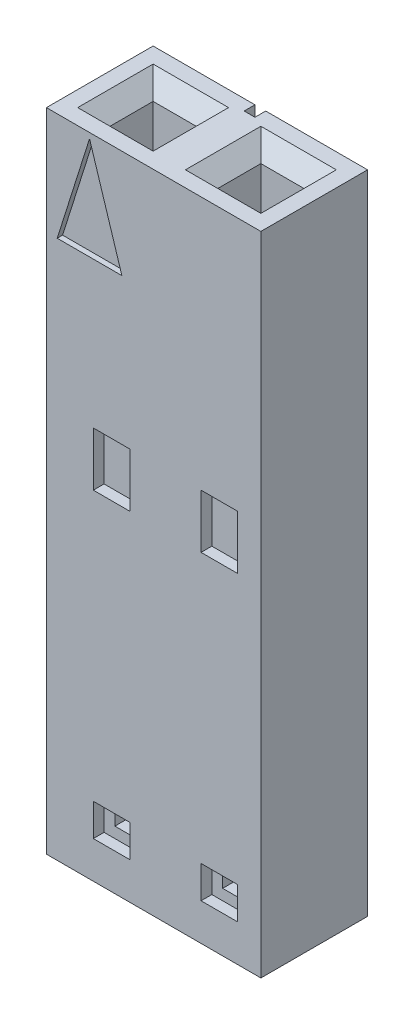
ISO-10303-21;
HEADER;
FILE_DESCRIPTION(('STEP AP214'),'2;1');
FILE_NAME('part.step','',(''),(''),'','','');
FILE_SCHEMA(('AUTOMOTIVE_DESIGN { 1 0 10303 214 1 1 1 1 }'));
ENDSEC;
DATA;
#1=APPLICATION_CONTEXT('core data for automotive mechanical design processes');
#2=APPLICATION_PROTOCOL_DEFINITION('international standard','automotive_design',2000,#1);
#3=PRODUCT_CONTEXT('',#1,'mechanical');
#4=PRODUCT('Part','Part','',(#3));
#5=PRODUCT_RELATED_PRODUCT_CATEGORY('part','',(#4));
#6=PRODUCT_DEFINITION_FORMATION('','',#4);
#7=PRODUCT_DEFINITION_CONTEXT('part definition',#1,'design');
#8=PRODUCT_DEFINITION('design','',#6,#7);
#9=PRODUCT_DEFINITION_SHAPE('','',#8);
#10=(LENGTH_UNIT() NAMED_UNIT(*) SI_UNIT(.MILLI.,.METRE.));
#11=(NAMED_UNIT(*) PLANE_ANGLE_UNIT() SI_UNIT($,.RADIAN.));
#12=(NAMED_UNIT(*) SI_UNIT($,.STERADIAN.) SOLID_ANGLE_UNIT());
#13=UNCERTAINTY_MEASURE_WITH_UNIT(LENGTH_MEASURE(1.E-05),#10,'distance_accuracy_value','');
#14=(GEOMETRIC_REPRESENTATION_CONTEXT(3) GLOBAL_UNCERTAINTY_ASSIGNED_CONTEXT((#13)) GLOBAL_UNIT_ASSIGNED_CONTEXT((#10,
#11,#12)) REPRESENTATION_CONTEXT('',''));
#15=CARTESIAN_POINT('',(0.,0.,0.));
#16=DIRECTION('',(0.,0.,1.));
#17=DIRECTION('',(1.,0.,0.));
#18=AXIS2_PLACEMENT_3D('',#15,#16,#17);
#19=CARTESIAN_POINT('',(-1.44190248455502,-6.91642,1.0033));
#20=DIRECTION('',(0.,0.,1.));
#21=DIRECTION('',(1.,0.,0.));
#22=AXIS2_PLACEMENT_3D('',#19,#20,#21);
#23=PLANE('',#22);
#24=DIRECTION('',(-1.,0.,0.));
#25=VECTOR('',#24,1.);
#26=CARTESIAN_POINT('',(-0.990599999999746,1.63322,1.0033));
#27=LINE('',#26,#25);
#28=CARTESIAN_POINT('',(-0.558799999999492,1.63322,1.0033));
#29=VERTEX_POINT('',#28);
#30=CARTESIAN_POINT('',(-1.4224,1.63322,1.0033));
#31=VERTEX_POINT('',#30);
#32=EDGE_CURVE('E714',#29,#31,#27,.T.);
#33=ORIENTED_EDGE('',*,*,#32,.T.);
#34=DIRECTION('',(0.,-1.,0.));
#35=VECTOR('',#34,1.);
#36=CARTESIAN_POINT('',(-1.4224,0.99822,1.0033));
#37=LINE('',#36,#35);
#38=CARTESIAN_POINT('',(-1.4224,0.36322,1.0033));
#39=VERTEX_POINT('',#38);
#40=EDGE_CURVE('E708',#31,#39,#37,.T.);
#41=ORIENTED_EDGE('',*,*,#40,.T.);
#42=DIRECTION('',(1.,0.,0.));
#43=VECTOR('',#42,1.);
#44=CARTESIAN_POINT('',(-0.990599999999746,0.36322,1.0033));
#45=LINE('',#44,#43);
#46=CARTESIAN_POINT('',(-0.558799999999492,0.36322,1.0033));
#47=VERTEX_POINT('',#46);
#48=EDGE_CURVE('E724',#39,#47,#45,.T.);
#49=ORIENTED_EDGE('',*,*,#48,.T.);
#50=DIRECTION('',(0.,1.,0.));
#51=VECTOR('',#50,1.);
#52=CARTESIAN_POINT('',(-0.558799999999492,0.99822,1.0033));
#53=LINE('',#52,#51);
#54=EDGE_CURVE('E719',#47,#29,#53,.T.);
#55=ORIENTED_EDGE('',*,*,#54,.T.);
#56=EDGE_LOOP('',(#33,#41,#49,#55));
#57=FACE_BOUND('',#56,.T.);
#58=ADVANCED_FACE('F30',(#57),#23,.T.);
#59=CARTESIAN_POINT('',(-1.44190248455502,-6.91642,1.0033));
#60=DIRECTION('',(0.,0.,1.));
#61=DIRECTION('',(1.,0.,0.));
#62=AXIS2_PLACEMENT_3D('',#59,#60,#61);
#63=PLANE('',#62);
#64=DIRECTION('',(0.,1.,0.));
#65=VECTOR('',#64,1.);
#66=CARTESIAN_POINT('',(-0.812799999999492,-6.49478,1.0033));
#67=LINE('',#66,#65);
#68=CARTESIAN_POINT('',(-0.812799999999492,-6.49478,1.0033));
#69=VERTEX_POINT('',#68);
#70=CARTESIAN_POINT('',(-0.812799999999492,-6.24078,1.0033));
#71=VERTEX_POINT('',#70);
#72=EDGE_CURVE('E403',#69,#71,#67,.T.);
#73=ORIENTED_EDGE('',*,*,#72,.F.);
#74=DIRECTION('',(1.,0.,0.));
#75=VECTOR('',#74,1.);
#76=CARTESIAN_POINT('',(-1.1684,-6.49478,1.0033));
#77=LINE('',#76,#75);
#78=CARTESIAN_POINT('',(-1.1684,-6.49478,1.0033));
#79=VERTEX_POINT('',#78);
#80=EDGE_CURVE('E413',#79,#69,#77,.T.);
#81=ORIENTED_EDGE('',*,*,#80,.F.);
#82=DIRECTION('',(0.,-1.,0.));
#83=VECTOR('',#82,1.);
#84=CARTESIAN_POINT('',(-1.1684,-6.24078,1.0033));
#85=LINE('',#84,#83);
#86=CARTESIAN_POINT('',(-1.1684,-6.24078,1.0033));
#87=VERTEX_POINT('',#86);
#88=EDGE_CURVE('E410',#87,#79,#85,.T.);
#89=ORIENTED_EDGE('',*,*,#88,.F.);
#90=DIRECTION('',(-1.,0.,0.));
#91=VECTOR('',#90,1.);
#92=CARTESIAN_POINT('',(-0.812799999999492,-6.24078,1.0033));
#93=LINE('',#92,#91);
#94=EDGE_CURVE('E407',#71,#87,#93,.T.);
#95=ORIENTED_EDGE('',*,*,#94,.F.);
#96=EDGE_LOOP('',(#73,#81,#89,#95));
#97=FACE_BOUND('',#96,.T.);
#98=DIRECTION('',(-1.,0.,0.));
#99=VECTOR('',#98,1.);
#100=CARTESIAN_POINT('',(-0.990599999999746,-5.98678,1.0033));
#101=LINE('',#100,#99);
#102=CARTESIAN_POINT('',(-0.558799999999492,-5.98678,1.0033));
#103=VERTEX_POINT('',#102);
#104=CARTESIAN_POINT('',(-1.4224,-5.98678,1.0033));
#105=VERTEX_POINT('',#104);
#106=EDGE_CURVE('E693',#103,#105,#101,.T.);
#107=ORIENTED_EDGE('',*,*,#106,.T.);
#108=DIRECTION('',(0.,-1.,0.));
#109=VECTOR('',#108,1.);
#110=CARTESIAN_POINT('',(-1.4224,-6.36778,1.0033));
#111=LINE('',#110,#109);
#112=CARTESIAN_POINT('',(-1.4224,-6.74878,1.0033));
#113=VERTEX_POINT('',#112);
#114=EDGE_CURVE('E687',#105,#113,#111,.T.);
#115=ORIENTED_EDGE('',*,*,#114,.T.);
#116=DIRECTION('',(1.,0.,0.));
#117=VECTOR('',#116,1.);
#118=CARTESIAN_POINT('',(-0.990599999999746,-6.74878,1.0033));
#119=LINE('',#118,#117);
#120=CARTESIAN_POINT('',(-0.558799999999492,-6.74878,1.0033));
#121=VERTEX_POINT('',#120);
#122=EDGE_CURVE('E703',#113,#121,#119,.T.);
#123=ORIENTED_EDGE('',*,*,#122,.T.);
#124=DIRECTION('',(0.,1.,0.));
#125=VECTOR('',#124,1.);
#126=CARTESIAN_POINT('',(-0.558799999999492,-6.36778,1.0033));
#127=LINE('',#126,#125);
#128=EDGE_CURVE('E698',#121,#103,#127,.T.);
#129=ORIENTED_EDGE('',*,*,#128,.T.);
#130=EDGE_LOOP('',(#107,#115,#123,#129));
#131=FACE_BOUND('',#130,.T.);
#132=ADVANCED_FACE('F954',(#97,#131),#63,.T.);
#133=CARTESIAN_POINT('',(1.09809751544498,-6.91642,1.0033));
#134=DIRECTION('',(0.,0.,1.));
#135=DIRECTION('',(1.,0.,0.));
#136=AXIS2_PLACEMENT_3D('',#133,#134,#135);
#137=PLANE('',#136);
#138=DIRECTION('',(-1.,0.,0.));
#139=VECTOR('',#138,1.);
#140=CARTESIAN_POINT('',(1.54940000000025,1.63322,1.0033));
#141=LINE('',#140,#139);
#142=CARTESIAN_POINT('',(1.98120000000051,1.63322,1.0033));
#143=VERTEX_POINT('',#142);
#144=CARTESIAN_POINT('',(1.1176,1.63322,1.0033));
#145=VERTEX_POINT('',#144);
#146=EDGE_CURVE('E672',#143,#145,#141,.T.);
#147=ORIENTED_EDGE('',*,*,#146,.T.);
#148=DIRECTION('',(0.,-1.,0.));
#149=VECTOR('',#148,1.);
#150=CARTESIAN_POINT('',(1.1176,0.99822,1.0033));
#151=LINE('',#150,#149);
#152=CARTESIAN_POINT('',(1.1176,0.36322,1.0033));
#153=VERTEX_POINT('',#152);
#154=EDGE_CURVE('E666',#145,#153,#151,.T.);
#155=ORIENTED_EDGE('',*,*,#154,.T.);
#156=DIRECTION('',(1.,0.,0.));
#157=VECTOR('',#156,1.);
#158=CARTESIAN_POINT('',(1.54940000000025,0.36322,1.0033));
#159=LINE('',#158,#157);
#160=CARTESIAN_POINT('',(1.98120000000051,0.36322,1.0033));
#161=VERTEX_POINT('',#160);
#162=EDGE_CURVE('E682',#153,#161,#159,.T.);
#163=ORIENTED_EDGE('',*,*,#162,.T.);
#164=DIRECTION('',(0.,1.,0.));
#165=VECTOR('',#164,1.);
#166=CARTESIAN_POINT('',(1.98120000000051,0.99822,1.0033));
#167=LINE('',#166,#165);
#168=EDGE_CURVE('E677',#161,#143,#167,.T.);
#169=ORIENTED_EDGE('',*,*,#168,.T.);
#170=EDGE_LOOP('',(#147,#155,#163,#169));
#171=FACE_BOUND('',#170,.T.);
#172=ADVANCED_FACE('F958',(#171),#137,.T.);
#173=CARTESIAN_POINT('',(1.09809751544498,-6.91642,1.0033));
#174=DIRECTION('',(0.,0.,1.));
#175=DIRECTION('',(1.,0.,0.));
#176=AXIS2_PLACEMENT_3D('',#173,#174,#175);
#177=PLANE('',#176);
#178=DIRECTION('',(0.,1.,0.));
#179=VECTOR('',#178,1.);
#180=CARTESIAN_POINT('',(1.72720000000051,-6.49478,1.0033));
#181=LINE('',#180,#179);
#182=CARTESIAN_POINT('',(1.72720000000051,-6.49478,1.0033));
#183=VERTEX_POINT('',#182);
#184=CARTESIAN_POINT('',(1.72720000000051,-6.24078,1.0033));
#185=VERTEX_POINT('',#184);
#186=EDGE_CURVE('E45',#183,#185,#181,.T.);
#187=ORIENTED_EDGE('',*,*,#186,.F.);
#188=DIRECTION('',(1.,0.,0.));
#189=VECTOR('',#188,1.);
#190=CARTESIAN_POINT('',(1.3716,-6.49478,1.0033));
#191=LINE('',#190,#189);
#192=CARTESIAN_POINT('',(1.3716,-6.49478,1.0033));
#193=VERTEX_POINT('',#192);
#194=EDGE_CURVE('E396',#193,#183,#191,.T.);
#195=ORIENTED_EDGE('',*,*,#194,.F.);
#196=DIRECTION('',(0.,-1.,0.));
#197=VECTOR('',#196,1.);
#198=CARTESIAN_POINT('',(1.3716,-6.24078,1.0033));
#199=LINE('',#198,#197);
#200=CARTESIAN_POINT('',(1.3716,-6.24078,1.0033));
#201=VERTEX_POINT('',#200);
#202=EDGE_CURVE('E380',#201,#193,#199,.T.);
#203=ORIENTED_EDGE('',*,*,#202,.F.);
#204=DIRECTION('',(-1.,0.,0.));
#205=VECTOR('',#204,1.);
#206=CARTESIAN_POINT('',(1.72720000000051,-6.24078,1.0033));
#207=LINE('',#206,#205);
#208=EDGE_CURVE('E389',#185,#201,#207,.T.);
#209=ORIENTED_EDGE('',*,*,#208,.F.);
#210=EDGE_LOOP('',(#187,#195,#203,#209));
#211=FACE_BOUND('',#210,.T.);
#212=DIRECTION('',(-1.,0.,0.));
#213=VECTOR('',#212,1.);
#214=CARTESIAN_POINT('',(1.54940000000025,-5.98678,1.0033));
#215=LINE('',#214,#213);
#216=CARTESIAN_POINT('',(1.98120000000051,-5.98678,1.0033));
#217=VERTEX_POINT('',#216);
#218=CARTESIAN_POINT('',(1.1176,-5.98678,1.0033));
#219=VERTEX_POINT('',#218);
#220=EDGE_CURVE('E651',#217,#219,#215,.T.);
#221=ORIENTED_EDGE('',*,*,#220,.T.);
#222=DIRECTION('',(0.,-1.,0.));
#223=VECTOR('',#222,1.);
#224=CARTESIAN_POINT('',(1.1176,-6.36778,1.0033));
#225=LINE('',#224,#223);
#226=CARTESIAN_POINT('',(1.1176,-6.74878,1.0033));
#227=VERTEX_POINT('',#226);
#228=EDGE_CURVE('E645',#219,#227,#225,.T.);
#229=ORIENTED_EDGE('',*,*,#228,.T.);
#230=DIRECTION('',(1.,0.,0.));
#231=VECTOR('',#230,1.);
#232=CARTESIAN_POINT('',(1.54940000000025,-6.74878,1.0033));
#233=LINE('',#232,#231);
#234=CARTESIAN_POINT('',(1.98120000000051,-6.74878,1.0033));
#235=VERTEX_POINT('',#234);
#236=EDGE_CURVE('E661',#227,#235,#233,.T.);
#237=ORIENTED_EDGE('',*,*,#236,.T.);
#238=DIRECTION('',(0.,1.,0.));
#239=VECTOR('',#238,1.);
#240=CARTESIAN_POINT('',(1.98120000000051,-6.36778,1.0033));
#241=LINE('',#240,#239);
#242=EDGE_CURVE('E656',#235,#217,#241,.T.);
#243=ORIENTED_EDGE('',*,*,#242,.T.);
#244=EDGE_LOOP('',(#221,#229,#237,#243));
#245=FACE_BOUND('',#244,.T.);
#246=ADVANCED_FACE('F393',(#211,#245),#177,.T.);
#247=CARTESIAN_POINT('',(-2.19456,7.63379033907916,0.902790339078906));
#248=DIRECTION('',(0.,0.707106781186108,-0.707106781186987));
#249=DIRECTION('',(1.,0.,0.));
#250=AXIS2_PLACEMENT_3D('',#247,#248,#249);
#251=PLANE('',#250);
#252=DIRECTION('',(-1.,0.,0.));
#253=VECTOR('',#252,1.);
#254=CARTESIAN_POINT('',(-1.27,7.23899999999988,0.508000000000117));
#255=LINE('',#254,#253);
#256=CARTESIAN_POINT('',(-1.77800000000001,7.23899999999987,0.507999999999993));
#257=VERTEX_POINT('',#256);
#258=CARTESIAN_POINT('',(-0.761999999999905,7.23899999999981,0.508000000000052));
#259=VERTEX_POINT('',#258);
#260=EDGE_CURVE('E552',#257,#259,#255,.F.);
#261=ORIENTED_EDGE('',*,*,#260,.F.);
#262=DIRECTION('',(-0.577350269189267,0.577350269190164,0.577350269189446));
#263=VECTOR('',#262,1.);
#264=CARTESIAN_POINT('',(-1.77800000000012,7.23899999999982,0.508000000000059));
#265=LINE('',#264,#263);
#266=CARTESIAN_POINT('',(-2.15899999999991,7.62000000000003,0.888999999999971));
#267=VERTEX_POINT('',#266);
#268=EDGE_CURVE('E751',#257,#267,#265,.T.);
#269=ORIENTED_EDGE('',*,*,#268,.T.);
#270=DIRECTION('',(-1.,0.,0.));
#271=VECTOR('',#270,1.);
#272=CARTESIAN_POINT('',(0.,7.62,0.889));
#273=LINE('',#272,#271);
#274=CARTESIAN_POINT('',(-0.381000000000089,7.62000000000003,0.888999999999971));
#275=VERTEX_POINT('',#274);
#276=EDGE_CURVE('E731',#267,#275,#273,.F.);
#277=ORIENTED_EDGE('',*,*,#276,.T.);
#278=DIRECTION('',(-0.577350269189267,-0.577350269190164,-0.577350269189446));
#279=VECTOR('',#278,1.);
#280=CARTESIAN_POINT('',(-0.381000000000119,7.62000000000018,0.888999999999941));
#281=LINE('',#280,#279);
#282=EDGE_CURVE('E736',#275,#259,#281,.T.);
#283=ORIENTED_EDGE('',*,*,#282,.T.);
#284=EDGE_LOOP('',(#261,#269,#277,#283));
#285=FACE_BOUND('',#284,.T.);
#286=ADVANCED_FACE('F965',(#285),#251,.T.);
#287=CARTESIAN_POINT('',(-0.367209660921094,7.63379033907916,0.92456));
#288=DIRECTION('',(-0.707106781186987,0.707106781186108,0.));
#289=DIRECTION('',(0.,0.,-1.));
#290=AXIS2_PLACEMENT_3D('',#287,#288,#289);
#291=PLANE('',#290);
#292=DIRECTION('',(0.,0.,1.));
#293=VECTOR('',#292,1.);
#294=CARTESIAN_POINT('',(-0.761999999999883,7.23899999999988,0.));
#295=LINE('',#294,#293);
#296=CARTESIAN_POINT('',(-0.762000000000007,7.23899999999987,-0.508000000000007));
#297=VERTEX_POINT('',#296);
#298=EDGE_CURVE('E737',#259,#297,#295,.F.);
#299=ORIENTED_EDGE('',*,*,#298,.F.);
#300=ORIENTED_EDGE('',*,*,#282,.F.);
#301=DIRECTION('',(0.,0.,1.));
#302=VECTOR('',#301,1.);
#303=CARTESIAN_POINT('',(-0.381,7.62,0.));
#304=LINE('',#303,#302);
#305=CARTESIAN_POINT('',(-0.381000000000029,7.62000000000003,-0.888999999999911));
#306=VERTEX_POINT('',#305);
#307=EDGE_CURVE('E727',#275,#306,#304,.F.);
#308=ORIENTED_EDGE('',*,*,#307,.T.);
#309=DIRECTION('',(-0.577350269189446,-0.577350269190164,0.577350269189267));
#310=VECTOR('',#309,1.);
#311=CARTESIAN_POINT('',(-0.381000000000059,7.62000000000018,-0.888999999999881));
#312=LINE('',#311,#310);
#313=EDGE_CURVE('E740',#306,#297,#312,.T.);
#314=ORIENTED_EDGE('',*,*,#313,.T.);
#315=EDGE_LOOP('',(#299,#300,#308,#314));
#316=FACE_BOUND('',#315,.T.);
#317=ADVANCED_FACE('F968',(#316),#291,.T.);
#318=CARTESIAN_POINT('',(-0.34544,7.63379033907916,-0.902790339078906));
#319=DIRECTION('',(0.,0.707106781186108,0.707106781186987));
#320=DIRECTION('',(-1.,0.,0.));
#321=AXIS2_PLACEMENT_3D('',#318,#319,#320);
#322=PLANE('',#321);
#323=DIRECTION('',(1.,0.,0.));
#324=VECTOR('',#323,1.);
#325=CARTESIAN_POINT('',(-1.27,7.239,-0.508));
#326=LINE('',#325,#324);
#327=CARTESIAN_POINT('',(-1.7780000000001,7.23899999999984,-0.508000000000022));
#328=VERTEX_POINT('',#327);
#329=EDGE_CURVE('E747',#328,#297,#326,.T.);
#330=ORIENTED_EDGE('',*,*,#329,.T.);
#331=ORIENTED_EDGE('',*,*,#313,.F.);
#332=DIRECTION('',(1.,0.,0.));
#333=VECTOR('',#332,1.);
#334=CARTESIAN_POINT('',(0.,7.62,-0.889));
#335=LINE('',#334,#333);
#336=CARTESIAN_POINT('',(-2.15899999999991,7.62000000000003,-0.888999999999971));
#337=VERTEX_POINT('',#336);
#338=EDGE_CURVE('E730',#306,#337,#335,.F.);
#339=ORIENTED_EDGE('',*,*,#338,.T.);
#340=DIRECTION('',(0.577350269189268,-0.577350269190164,0.577350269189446));
#341=VECTOR('',#340,1.);
#342=CARTESIAN_POINT('',(-2.15899999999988,7.62000000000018,-0.888999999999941));
#343=LINE('',#342,#341);
#344=EDGE_CURVE('E800',#337,#328,#343,.T.);
#345=ORIENTED_EDGE('',*,*,#344,.T.);
#346=EDGE_LOOP('',(#330,#331,#339,#345));
#347=FACE_BOUND('',#346,.T.);
#348=ADVANCED_FACE('F972',(#347),#322,.T.);
#349=CARTESIAN_POINT('',(0.34544,7.63379033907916,0.902790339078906));
#350=DIRECTION('',(0.,0.707106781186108,-0.707106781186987));
#351=DIRECTION('',(1.,0.,0.));
#352=AXIS2_PLACEMENT_3D('',#349,#350,#351);
#353=PLANE('',#352);
#354=DIRECTION('',(-1.,0.,0.));
#355=VECTOR('',#354,1.);
#356=CARTESIAN_POINT('',(1.27,7.23899999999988,0.508000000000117));
#357=LINE('',#356,#355);
#358=CARTESIAN_POINT('',(0.761999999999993,7.23899999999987,0.507999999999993));
#359=VERTEX_POINT('',#358);
#360=CARTESIAN_POINT('',(1.7780000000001,7.23899999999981,0.508000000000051));
#361=VERTEX_POINT('',#360);
#362=EDGE_CURVE('E763',#359,#361,#357,.F.);
#363=ORIENTED_EDGE('',*,*,#362,.F.);
#364=DIRECTION('',(-0.577350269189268,0.577350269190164,0.577350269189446));
#365=VECTOR('',#364,1.);
#366=CARTESIAN_POINT('',(0.761999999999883,7.23899999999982,0.508000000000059));
#367=LINE('',#366,#365);
#368=CARTESIAN_POINT('',(0.381000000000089,7.62000000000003,0.888999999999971));
#369=VERTEX_POINT('',#368);
#370=EDGE_CURVE('E777',#359,#369,#367,.T.);
#371=ORIENTED_EDGE('',*,*,#370,.T.);
#372=DIRECTION('',(-1.,0.,0.));
#373=VECTOR('',#372,1.);
#374=CARTESIAN_POINT('',(0.,7.62,0.889));
#375=LINE('',#374,#373);
#376=CARTESIAN_POINT('',(2.15899999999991,7.62000000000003,0.888999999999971));
#377=VERTEX_POINT('',#376);
#378=EDGE_CURVE('E760',#369,#377,#375,.F.);
#379=ORIENTED_EDGE('',*,*,#378,.T.);
#380=DIRECTION('',(-0.577350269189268,-0.577350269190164,-0.577350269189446));
#381=VECTOR('',#380,1.);
#382=CARTESIAN_POINT('',(2.15899999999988,7.62000000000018,0.888999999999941));
#383=LINE('',#382,#381);
#384=EDGE_CURVE('E766',#377,#361,#383,.T.);
#385=ORIENTED_EDGE('',*,*,#384,.T.);
#386=EDGE_LOOP('',(#363,#371,#379,#385));
#387=FACE_BOUND('',#386,.T.);
#388=ADVANCED_FACE('F976',(#387),#353,.T.);
#389=CARTESIAN_POINT('',(2.17279033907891,7.63379033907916,0.92456));
#390=DIRECTION('',(-0.707106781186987,0.707106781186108,0.));
#391=DIRECTION('',(0.,0.,-1.));
#392=AXIS2_PLACEMENT_3D('',#389,#390,#391);
#393=PLANE('',#392);
#394=DIRECTION('',(0.,0.,1.));
#395=VECTOR('',#394,1.);
#396=CARTESIAN_POINT('',(1.77800000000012,7.23899999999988,0.));
#397=LINE('',#396,#395);
#398=CARTESIAN_POINT('',(1.77799999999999,7.23899999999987,-0.508000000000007));
#399=VERTEX_POINT('',#398);
#400=EDGE_CURVE('E767',#361,#399,#397,.F.);
#401=ORIENTED_EDGE('',*,*,#400,.F.);
#402=ORIENTED_EDGE('',*,*,#384,.F.);
#403=DIRECTION('',(0.,0.,1.));
#404=VECTOR('',#403,1.);
#405=CARTESIAN_POINT('',(2.159,7.62,0.));
#406=LINE('',#405,#404);
#407=CARTESIAN_POINT('',(2.15899999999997,7.62000000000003,-0.888999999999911));
#408=VERTEX_POINT('',#407);
#409=EDGE_CURVE('E756',#377,#408,#406,.F.);
#410=ORIENTED_EDGE('',*,*,#409,.T.);
#411=DIRECTION('',(-0.577350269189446,-0.577350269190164,0.577350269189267));
#412=VECTOR('',#411,1.);
#413=CARTESIAN_POINT('',(2.15899999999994,7.62000000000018,-0.888999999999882));
#414=LINE('',#413,#412);
#415=EDGE_CURVE('E770',#408,#399,#414,.T.);
#416=ORIENTED_EDGE('',*,*,#415,.T.);
#417=EDGE_LOOP('',(#401,#402,#410,#416));
#418=FACE_BOUND('',#417,.T.);
#419=ADVANCED_FACE('F980',(#418),#393,.T.);
#420=CARTESIAN_POINT('',(2.19456,7.63379033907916,-0.902790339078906));
#421=DIRECTION('',(0.,0.707106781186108,0.707106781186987));
#422=DIRECTION('',(-1.,0.,0.));
#423=AXIS2_PLACEMENT_3D('',#420,#421,#422);
#424=PLANE('',#423);
#425=DIRECTION('',(1.,0.,0.));
#426=VECTOR('',#425,1.);
#427=CARTESIAN_POINT('',(1.27,7.239,-0.508));
#428=LINE('',#427,#426);
#429=CARTESIAN_POINT('',(0.761999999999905,7.23899999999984,-0.508000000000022));
#430=VERTEX_POINT('',#429);
#431=EDGE_CURVE('E726',#430,#399,#428,.T.);
#432=ORIENTED_EDGE('',*,*,#431,.T.);
#433=ORIENTED_EDGE('',*,*,#415,.F.);
#434=DIRECTION('',(1.,0.,0.));
#435=VECTOR('',#434,1.);
#436=CARTESIAN_POINT('',(0.,7.62,-0.889));
#437=LINE('',#436,#435);
#438=CARTESIAN_POINT('',(0.381000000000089,7.62000000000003,-0.888999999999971));
#439=VERTEX_POINT('',#438);
#440=EDGE_CURVE('E759',#408,#439,#437,.F.);
#441=ORIENTED_EDGE('',*,*,#440,.T.);
#442=DIRECTION('',(0.577350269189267,-0.577350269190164,0.577350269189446));
#443=VECTOR('',#442,1.);
#444=CARTESIAN_POINT('',(0.381000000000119,7.62000000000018,-0.888999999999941));
#445=LINE('',#444,#443);
#446=EDGE_CURVE('E750',#439,#430,#445,.T.);
#447=ORIENTED_EDGE('',*,*,#446,.T.);
#448=EDGE_LOOP('',(#432,#433,#441,#447));
#449=FACE_BOUND('',#448,.T.);
#450=ADVANCED_FACE('F984',(#449),#424,.T.);
#451=CARTESIAN_POINT('',(-2.17279033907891,7.63379033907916,-0.92456));
#452=DIRECTION('',(0.707106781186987,0.707106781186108,0.));
#453=DIRECTION('',(0.,0.,1.));
#454=AXIS2_PLACEMENT_3D('',#451,#452,#453);
#455=PLANE('',#454);
#456=DIRECTION('',(0.,0.,-1.));
#457=VECTOR('',#456,1.);
#458=CARTESIAN_POINT('',(-1.778,7.239,0.));
#459=LINE('',#458,#457);
#460=EDGE_CURVE('E774',#257,#328,#459,.T.);
#461=ORIENTED_EDGE('',*,*,#460,.T.);
#462=ORIENTED_EDGE('',*,*,#344,.F.);
#463=DIRECTION('',(0.,0.,-1.));
#464=VECTOR('',#463,1.);
#465=CARTESIAN_POINT('',(-2.159,7.62,0.));
#466=LINE('',#465,#464);
#467=EDGE_CURVE('E644',#337,#267,#466,.F.);
#468=ORIENTED_EDGE('',*,*,#467,.T.);
#469=ORIENTED_EDGE('',*,*,#268,.F.);
#470=EDGE_LOOP('',(#461,#462,#468,#469));
#471=FACE_BOUND('',#470,.T.);
#472=ADVANCED_FACE('F988',(#471),#455,.T.);
#473=CARTESIAN_POINT('',(-0.74168,-7.91718,-0.508));
#474=DIRECTION('',(0.,0.,-1.));
#475=DIRECTION('',(-1.,0.,0.));
#476=AXIS2_PLACEMENT_3D('',#473,#474,#475);
#477=PLANE('',#476);
#478=DIRECTION('',(0.,-1.,0.));
#479=VECTOR('',#478,1.);
#480=CARTESIAN_POINT('',(-1.778,-0.190499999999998,-0.508));
#481=LINE('',#480,#479);
#482=CARTESIAN_POINT('',(-1.778,-7.112,-0.508000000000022));
#483=VERTEX_POINT('',#482);
#484=EDGE_CURVE('E755',#328,#483,#481,.T.);
#485=ORIENTED_EDGE('',*,*,#484,.T.);
#486=DIRECTION('',(1.,0.,0.));
#487=VECTOR('',#486,1.);
#488=CARTESIAN_POINT('',(-0.74168,-7.112,-0.508));
#489=LINE('',#488,#487);
#490=CARTESIAN_POINT('',(-0.762,-7.112,-0.508000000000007));
#491=VERTEX_POINT('',#490);
#492=EDGE_CURVE('E512',#483,#491,#489,.T.);
#493=ORIENTED_EDGE('',*,*,#492,.T.);
#494=DIRECTION('',(0.,1.,0.));
#495=VECTOR('',#494,1.);
#496=CARTESIAN_POINT('',(-0.762,-0.190499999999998,-0.508));
#497=LINE('',#496,#495);
#498=EDGE_CURVE('E752',#491,#297,#497,.T.);
#499=ORIENTED_EDGE('',*,*,#498,.T.);
#500=ORIENTED_EDGE('',*,*,#329,.F.);
#501=EDGE_LOOP('',(#485,#493,#499,#500));
#502=FACE_BOUND('',#501,.T.);
#503=ADVANCED_FACE('F992',(#502),#477,.F.);
#504=CARTESIAN_POINT('',(0.367209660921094,7.63379033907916,-0.92456));
#505=DIRECTION('',(0.707106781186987,0.707106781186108,0.));
#506=DIRECTION('',(0.,0.,1.));
#507=AXIS2_PLACEMENT_3D('',#504,#505,#506);
#508=PLANE('',#507);
#509=DIRECTION('',(0.,0.,-1.));
#510=VECTOR('',#509,1.);
#511=CARTESIAN_POINT('',(0.762,7.239,0.));
#512=LINE('',#511,#510);
#513=EDGE_CURVE('E754',#359,#430,#512,.T.);
#514=ORIENTED_EDGE('',*,*,#513,.T.);
#515=ORIENTED_EDGE('',*,*,#446,.F.);
#516=DIRECTION('',(0.,0.,-1.));
#517=VECTOR('',#516,1.);
#518=CARTESIAN_POINT('',(0.381000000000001,7.62,0.));
#519=LINE('',#518,#517);
#520=EDGE_CURVE('E746',#439,#369,#519,.F.);
#521=ORIENTED_EDGE('',*,*,#520,.T.);
#522=ORIENTED_EDGE('',*,*,#370,.F.);
#523=EDGE_LOOP('',(#514,#515,#521,#522));
#524=FACE_BOUND('',#523,.T.);
#525=ADVANCED_FACE('F996',(#524),#508,.T.);
#526=CARTESIAN_POINT('',(1.79832,-7.91718,-0.508));
#527=DIRECTION('',(0.,0.,-1.));
#528=DIRECTION('',(-1.,0.,0.));
#529=AXIS2_PLACEMENT_3D('',#526,#527,#528);
#530=PLANE('',#529);
#531=DIRECTION('',(0.,-1.,0.));
#532=VECTOR('',#531,1.);
#533=CARTESIAN_POINT('',(0.762,-0.190499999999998,-0.508));
#534=LINE('',#533,#532);
#535=CARTESIAN_POINT('',(0.762,-7.112,-0.508000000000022));
#536=VERTEX_POINT('',#535);
#537=EDGE_CURVE('E779',#430,#536,#534,.T.);
#538=ORIENTED_EDGE('',*,*,#537,.T.);
#539=DIRECTION('',(1.,0.,0.));
#540=VECTOR('',#539,1.);
#541=CARTESIAN_POINT('',(1.79832,-7.112,-0.508));
#542=LINE('',#541,#540);
#543=CARTESIAN_POINT('',(1.778,-7.112,-0.508000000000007));
#544=VERTEX_POINT('',#543);
#545=EDGE_CURVE('E549',#536,#544,#542,.T.);
#546=ORIENTED_EDGE('',*,*,#545,.T.);
#547=DIRECTION('',(0.,1.,0.));
#548=VECTOR('',#547,1.);
#549=CARTESIAN_POINT('',(1.778,-0.190499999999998,-0.508));
#550=LINE('',#549,#548);
#551=EDGE_CURVE('E640',#544,#399,#550,.T.);
#552=ORIENTED_EDGE('',*,*,#551,.T.);
#553=ORIENTED_EDGE('',*,*,#431,.F.);
#554=EDGE_LOOP('',(#538,#546,#552,#553));
#555=FACE_BOUND('',#554,.T.);
#556=ADVANCED_FACE('F1000',(#555),#530,.F.);
#557=CARTESIAN_POINT('',(-1.44190248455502,0.36322,0.983797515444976));
#558=DIRECTION('',(0.,-1.,0.));
#559=DIRECTION('',(1.,0.,0.));
#560=AXIS2_PLACEMENT_3D('',#557,#558,#559);
#561=PLANE('',#560);
#562=ORIENTED_EDGE('',*,*,#48,.F.);
#563=DIRECTION('',(0.,0.,1.));
#564=VECTOR('',#563,1.);
#565=CARTESIAN_POINT('',(-1.4224,0.36322,1.1303));
#566=LINE('',#565,#564);
#567=CARTESIAN_POINT('',(-1.4224,0.36322,1.2573));
#568=VERTEX_POINT('',#567);
#569=EDGE_CURVE('E705',#39,#568,#566,.T.);
#570=ORIENTED_EDGE('',*,*,#569,.T.);
#571=DIRECTION('',(-1.,0.,0.));
#572=VECTOR('',#571,1.);
#573=CARTESIAN_POINT('',(0.,0.363219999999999,1.2573));
#574=LINE('',#573,#572);
#575=CARTESIAN_POINT('',(-0.558799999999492,0.36322,1.2573));
#576=VERTEX_POINT('',#575);
#577=EDGE_CURVE('E630',#568,#576,#574,.F.);
#578=ORIENTED_EDGE('',*,*,#577,.T.);
#579=DIRECTION('',(0.,0.,-1.));
#580=VECTOR('',#579,1.);
#581=CARTESIAN_POINT('',(-0.558799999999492,0.36322,1.1303));
#582=LINE('',#581,#580);
#583=EDGE_CURVE('E721',#576,#47,#582,.T.);
#584=ORIENTED_EDGE('',*,*,#583,.T.);
#585=EDGE_LOOP('',(#562,#570,#578,#584));
#586=FACE_BOUND('',#585,.T.);
#587=ADVANCED_FACE('F1004',(#586),#561,.F.);
#588=CARTESIAN_POINT('',(-0.558799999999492,0.33782,0.983797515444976));
#589=DIRECTION('',(1.,0.,0.));
#590=DIRECTION('',(0.,1.,0.));
#591=AXIS2_PLACEMENT_3D('',#588,#589,#590);
#592=PLANE('',#591);
#593=ORIENTED_EDGE('',*,*,#54,.F.);
#594=ORIENTED_EDGE('',*,*,#583,.F.);
#595=DIRECTION('',(0.,-1.,0.));
#596=VECTOR('',#595,1.);
#597=CARTESIAN_POINT('',(-0.558799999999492,0.,1.2573));
#598=LINE('',#597,#596);
#599=CARTESIAN_POINT('',(-0.558799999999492,1.63322,1.2573));
#600=VERTEX_POINT('',#599);
#601=EDGE_CURVE('E627',#576,#600,#598,.F.);
#602=ORIENTED_EDGE('',*,*,#601,.T.);
#603=DIRECTION('',(0.,0.,-1.));
#604=VECTOR('',#603,1.);
#605=CARTESIAN_POINT('',(-0.558799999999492,1.63322,1.1303));
#606=LINE('',#605,#604);
#607=EDGE_CURVE('E716',#600,#29,#606,.T.);
#608=ORIENTED_EDGE('',*,*,#607,.T.);
#609=EDGE_LOOP('',(#593,#594,#602,#608));
#610=FACE_BOUND('',#609,.T.);
#611=ADVANCED_FACE('F1008',(#610),#592,.F.);
#612=CARTESIAN_POINT('',(-0.539297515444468,1.63322,0.983797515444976));
#613=DIRECTION('',(0.,1.,0.));
#614=DIRECTION('',(-1.,0.,0.));
#615=AXIS2_PLACEMENT_3D('',#612,#613,#614);
#616=PLANE('',#615);
#617=ORIENTED_EDGE('',*,*,#32,.F.);
#618=ORIENTED_EDGE('',*,*,#607,.F.);
#619=DIRECTION('',(1.,0.,0.));
#620=VECTOR('',#619,1.);
#621=CARTESIAN_POINT('',(0.,1.63322,1.2573));
#622=LINE('',#621,#620);
#623=CARTESIAN_POINT('',(-1.4224,1.63322,1.2573));
#624=VERTEX_POINT('',#623);
#625=EDGE_CURVE('E624',#600,#624,#622,.F.);
#626=ORIENTED_EDGE('',*,*,#625,.T.);
#627=DIRECTION('',(0.,0.,-1.));
#628=VECTOR('',#627,1.);
#629=CARTESIAN_POINT('',(-1.4224,1.63322,1.1303));
#630=LINE('',#629,#628);
#631=EDGE_CURVE('E711',#624,#31,#630,.T.);
#632=ORIENTED_EDGE('',*,*,#631,.T.);
#633=EDGE_LOOP('',(#617,#618,#626,#632));
#634=FACE_BOUND('',#633,.T.);
#635=ADVANCED_FACE('F1012',(#634),#616,.F.);
#636=CARTESIAN_POINT('',(-1.4224,1.65862,0.983797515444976));
#637=DIRECTION('',(-1.,0.,0.));
#638=DIRECTION('',(0.,-1.,0.));
#639=AXIS2_PLACEMENT_3D('',#636,#637,#638);
#640=PLANE('',#639);
#641=ORIENTED_EDGE('',*,*,#40,.F.);
#642=ORIENTED_EDGE('',*,*,#631,.F.);
#643=DIRECTION('',(0.,1.,0.));
#644=VECTOR('',#643,1.);
#645=CARTESIAN_POINT('',(-1.4224,0.,1.2573));
#646=LINE('',#645,#644);
#647=EDGE_CURVE('E621',#624,#568,#646,.F.);
#648=ORIENTED_EDGE('',*,*,#647,.T.);
#649=ORIENTED_EDGE('',*,*,#569,.F.);
#650=EDGE_LOOP('',(#641,#642,#648,#649));
#651=FACE_BOUND('',#650,.T.);
#652=ADVANCED_FACE('F1016',(#651),#640,.F.);
#653=CARTESIAN_POINT('',(-1.44190248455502,-6.74878,0.983797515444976));
#654=DIRECTION('',(0.,-1.,0.));
#655=DIRECTION('',(1.,0.,0.));
#656=AXIS2_PLACEMENT_3D('',#653,#654,#655);
#657=PLANE('',#656);
#658=ORIENTED_EDGE('',*,*,#122,.F.);
#659=DIRECTION('',(0.,0.,1.));
#660=VECTOR('',#659,1.);
#661=CARTESIAN_POINT('',(-1.4224,-6.74878,1.1303));
#662=LINE('',#661,#660);
#663=CARTESIAN_POINT('',(-1.4224,-6.74878,1.2573));
#664=VERTEX_POINT('',#663);
#665=EDGE_CURVE('E684',#113,#664,#662,.T.);
#666=ORIENTED_EDGE('',*,*,#665,.T.);
#667=DIRECTION('',(-1.,0.,0.));
#668=VECTOR('',#667,1.);
#669=CARTESIAN_POINT('',(0.,-6.74878,1.2573));
#670=LINE('',#669,#668);
#671=CARTESIAN_POINT('',(-0.558799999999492,-6.74878,1.2573));
#672=VERTEX_POINT('',#671);
#673=EDGE_CURVE('E618',#664,#672,#670,.F.);
#674=ORIENTED_EDGE('',*,*,#673,.T.);
#675=DIRECTION('',(0.,0.,-1.));
#676=VECTOR('',#675,1.);
#677=CARTESIAN_POINT('',(-0.558799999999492,-6.74878,1.1303));
#678=LINE('',#677,#676);
#679=EDGE_CURVE('E700',#672,#121,#678,.T.);
#680=ORIENTED_EDGE('',*,*,#679,.T.);
#681=EDGE_LOOP('',(#658,#666,#674,#680));
#682=FACE_BOUND('',#681,.T.);
#683=ADVANCED_FACE('F1020',(#682),#657,.F.);
#684=CARTESIAN_POINT('',(-0.558799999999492,-6.76828248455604,0.983797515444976));
#685=DIRECTION('',(1.,0.,0.));
#686=DIRECTION('',(0.,1.,0.));
#687=AXIS2_PLACEMENT_3D('',#684,#685,#686);
#688=PLANE('',#687);
#689=ORIENTED_EDGE('',*,*,#128,.F.);
#690=ORIENTED_EDGE('',*,*,#679,.F.);
#691=DIRECTION('',(0.,-1.,0.));
#692=VECTOR('',#691,1.);
#693=CARTESIAN_POINT('',(-0.558799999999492,0.,1.2573));
#694=LINE('',#693,#692);
#695=CARTESIAN_POINT('',(-0.558799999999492,-5.98678,1.2573));
#696=VERTEX_POINT('',#695);
#697=EDGE_CURVE('E615',#672,#696,#694,.F.);
#698=ORIENTED_EDGE('',*,*,#697,.T.);
#699=DIRECTION('',(0.,0.,-1.));
#700=VECTOR('',#699,1.);
#701=CARTESIAN_POINT('',(-0.558799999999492,-5.98678,1.1303));
#702=LINE('',#701,#700);
#703=EDGE_CURVE('E695',#696,#103,#702,.T.);
#704=ORIENTED_EDGE('',*,*,#703,.T.);
#705=EDGE_LOOP('',(#689,#690,#698,#704));
#706=FACE_BOUND('',#705,.T.);
#707=ADVANCED_FACE('F1024',(#706),#688,.F.);
#708=CARTESIAN_POINT('',(-0.539297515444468,-5.98678,0.983797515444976));
#709=DIRECTION('',(0.,1.,0.));
#710=DIRECTION('',(-1.,0.,0.));
#711=AXIS2_PLACEMENT_3D('',#708,#709,#710);
#712=PLANE('',#711);
#713=ORIENTED_EDGE('',*,*,#106,.F.);
#714=ORIENTED_EDGE('',*,*,#703,.F.);
#715=DIRECTION('',(1.,0.,0.));
#716=VECTOR('',#715,1.);
#717=CARTESIAN_POINT('',(0.,-5.98678,1.2573));
#718=LINE('',#717,#716);
#719=CARTESIAN_POINT('',(-1.4224,-5.98678,1.2573));
#720=VERTEX_POINT('',#719);
#721=EDGE_CURVE('E612',#696,#720,#718,.F.);
#722=ORIENTED_EDGE('',*,*,#721,.T.);
#723=DIRECTION('',(0.,0.,-1.));
#724=VECTOR('',#723,1.);
#725=CARTESIAN_POINT('',(-1.4224,-5.98678,1.1303));
#726=LINE('',#725,#724);
#727=EDGE_CURVE('E690',#720,#105,#726,.T.);
#728=ORIENTED_EDGE('',*,*,#727,.T.);
#729=EDGE_LOOP('',(#713,#714,#722,#728));
#730=FACE_BOUND('',#729,.T.);
#731=ADVANCED_FACE('F1028',(#730),#712,.F.);
#732=CARTESIAN_POINT('',(-1.4224,-5.96727751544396,0.983797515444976));
#733=DIRECTION('',(-1.,0.,0.));
#734=DIRECTION('',(0.,-1.,0.));
#735=AXIS2_PLACEMENT_3D('',#732,#733,#734);
#736=PLANE('',#735);
#737=ORIENTED_EDGE('',*,*,#114,.F.);
#738=ORIENTED_EDGE('',*,*,#727,.F.);
#739=DIRECTION('',(0.,1.,0.));
#740=VECTOR('',#739,1.);
#741=CARTESIAN_POINT('',(-1.4224,0.,1.2573));
#742=LINE('',#741,#740);
#743=EDGE_CURVE('E609',#720,#664,#742,.F.);
#744=ORIENTED_EDGE('',*,*,#743,.T.);
#745=ORIENTED_EDGE('',*,*,#665,.F.);
#746=EDGE_LOOP('',(#737,#738,#744,#745));
#747=FACE_BOUND('',#746,.T.);
#748=ADVANCED_FACE('F1032',(#747),#736,.F.);
#749=CARTESIAN_POINT('',(1.09809751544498,0.36322,0.983797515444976));
#750=DIRECTION('',(0.,-1.,0.));
#751=DIRECTION('',(1.,0.,0.));
#752=AXIS2_PLACEMENT_3D('',#749,#750,#751);
#753=PLANE('',#752);
#754=ORIENTED_EDGE('',*,*,#162,.F.);
#755=DIRECTION('',(0.,0.,1.));
#756=VECTOR('',#755,1.);
#757=CARTESIAN_POINT('',(1.1176,0.36322,1.1303));
#758=LINE('',#757,#756);
#759=CARTESIAN_POINT('',(1.1176,0.36322,1.2573));
#760=VERTEX_POINT('',#759);
#761=EDGE_CURVE('E663',#153,#760,#758,.T.);
#762=ORIENTED_EDGE('',*,*,#761,.T.);
#763=DIRECTION('',(-1.,0.,0.));
#764=VECTOR('',#763,1.);
#765=CARTESIAN_POINT('',(0.,0.363219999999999,1.2573));
#766=LINE('',#765,#764);
#767=CARTESIAN_POINT('',(1.98120000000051,0.36322,1.2573));
#768=VERTEX_POINT('',#767);
#769=EDGE_CURVE('E606',#760,#768,#766,.F.);
#770=ORIENTED_EDGE('',*,*,#769,.T.);
#771=DIRECTION('',(0.,0.,-1.));
#772=VECTOR('',#771,1.);
#773=CARTESIAN_POINT('',(1.98120000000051,0.36322,1.1303));
#774=LINE('',#773,#772);
#775=EDGE_CURVE('E679',#768,#161,#774,.T.);
#776=ORIENTED_EDGE('',*,*,#775,.T.);
#777=EDGE_LOOP('',(#754,#762,#770,#776));
#778=FACE_BOUND('',#777,.T.);
#779=ADVANCED_FACE('F1036',(#778),#753,.F.);
#780=CARTESIAN_POINT('',(1.98120000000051,0.33782,0.983797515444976));
#781=DIRECTION('',(1.,0.,0.));
#782=DIRECTION('',(0.,1.,0.));
#783=AXIS2_PLACEMENT_3D('',#780,#781,#782);
#784=PLANE('',#783);
#785=ORIENTED_EDGE('',*,*,#168,.F.);
#786=ORIENTED_EDGE('',*,*,#775,.F.);
#787=DIRECTION('',(0.,-1.,0.));
#788=VECTOR('',#787,1.);
#789=CARTESIAN_POINT('',(1.98120000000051,0.,1.2573));
#790=LINE('',#789,#788);
#791=CARTESIAN_POINT('',(1.98120000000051,1.63322,1.2573));
#792=VERTEX_POINT('',#791);
#793=EDGE_CURVE('E603',#768,#792,#790,.F.);
#794=ORIENTED_EDGE('',*,*,#793,.T.);
#795=DIRECTION('',(0.,0.,-1.));
#796=VECTOR('',#795,1.);
#797=CARTESIAN_POINT('',(1.98120000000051,1.63322,1.1303));
#798=LINE('',#797,#796);
#799=EDGE_CURVE('E674',#792,#143,#798,.T.);
#800=ORIENTED_EDGE('',*,*,#799,.T.);
#801=EDGE_LOOP('',(#785,#786,#794,#800));
#802=FACE_BOUND('',#801,.T.);
#803=ADVANCED_FACE('F1040',(#802),#784,.F.);
#804=CARTESIAN_POINT('',(2.00070248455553,1.63322,0.983797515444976));
#805=DIRECTION('',(0.,1.,0.));
#806=DIRECTION('',(-1.,0.,0.));
#807=AXIS2_PLACEMENT_3D('',#804,#805,#806);
#808=PLANE('',#807);
#809=ORIENTED_EDGE('',*,*,#146,.F.);
#810=ORIENTED_EDGE('',*,*,#799,.F.);
#811=DIRECTION('',(1.,0.,0.));
#812=VECTOR('',#811,1.);
#813=CARTESIAN_POINT('',(0.,1.63322,1.2573));
#814=LINE('',#813,#812);
#815=CARTESIAN_POINT('',(1.1176,1.63322,1.2573));
#816=VERTEX_POINT('',#815);
#817=EDGE_CURVE('E600',#792,#816,#814,.F.);
#818=ORIENTED_EDGE('',*,*,#817,.T.);
#819=DIRECTION('',(0.,0.,-1.));
#820=VECTOR('',#819,1.);
#821=CARTESIAN_POINT('',(1.1176,1.63322,1.1303));
#822=LINE('',#821,#820);
#823=EDGE_CURVE('E669',#816,#145,#822,.T.);
#824=ORIENTED_EDGE('',*,*,#823,.T.);
#825=EDGE_LOOP('',(#809,#810,#818,#824));
#826=FACE_BOUND('',#825,.T.);
#827=ADVANCED_FACE('F1044',(#826),#808,.F.);
#828=CARTESIAN_POINT('',(1.1176,1.65862,0.983797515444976));
#829=DIRECTION('',(-1.,0.,0.));
#830=DIRECTION('',(0.,-1.,0.));
#831=AXIS2_PLACEMENT_3D('',#828,#829,#830);
#832=PLANE('',#831);
#833=ORIENTED_EDGE('',*,*,#154,.F.);
#834=ORIENTED_EDGE('',*,*,#823,.F.);
#835=DIRECTION('',(0.,1.,0.));
#836=VECTOR('',#835,1.);
#837=CARTESIAN_POINT('',(1.1176,0.,1.2573));
#838=LINE('',#837,#836);
#839=EDGE_CURVE('E597',#816,#760,#838,.F.);
#840=ORIENTED_EDGE('',*,*,#839,.T.);
#841=ORIENTED_EDGE('',*,*,#761,.F.);
#842=EDGE_LOOP('',(#833,#834,#840,#841));
#843=FACE_BOUND('',#842,.T.);
#844=ADVANCED_FACE('F1048',(#843),#832,.F.);
#845=CARTESIAN_POINT('',(1.09809751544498,-6.74878,0.983797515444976));
#846=DIRECTION('',(0.,-1.,0.));
#847=DIRECTION('',(1.,0.,0.));
#848=AXIS2_PLACEMENT_3D('',#845,#846,#847);
#849=PLANE('',#848);
#850=ORIENTED_EDGE('',*,*,#236,.F.);
#851=DIRECTION('',(0.,0.,1.));
#852=VECTOR('',#851,1.);
#853=CARTESIAN_POINT('',(1.1176,-6.74878,1.1303));
#854=LINE('',#853,#852);
#855=CARTESIAN_POINT('',(1.1176,-6.74878,1.2573));
#856=VERTEX_POINT('',#855);
#857=EDGE_CURVE('E641',#227,#856,#854,.T.);
#858=ORIENTED_EDGE('',*,*,#857,.T.);
#859=DIRECTION('',(-1.,0.,0.));
#860=VECTOR('',#859,1.);
#861=CARTESIAN_POINT('',(0.,-6.74878,1.2573));
#862=LINE('',#861,#860);
#863=CARTESIAN_POINT('',(1.98120000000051,-6.74878,1.2573));
#864=VERTEX_POINT('',#863);
#865=EDGE_CURVE('E594',#856,#864,#862,.F.);
#866=ORIENTED_EDGE('',*,*,#865,.T.);
#867=DIRECTION('',(0.,0.,-1.));
#868=VECTOR('',#867,1.);
#869=CARTESIAN_POINT('',(1.98120000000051,-6.74878,1.1303));
#870=LINE('',#869,#868);
#871=EDGE_CURVE('E658',#864,#235,#870,.T.);
#872=ORIENTED_EDGE('',*,*,#871,.T.);
#873=EDGE_LOOP('',(#850,#858,#866,#872));
#874=FACE_BOUND('',#873,.T.);
#875=ADVANCED_FACE('F1052',(#874),#849,.F.);
#876=CARTESIAN_POINT('',(1.98120000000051,-6.76828248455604,0.983797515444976));
#877=DIRECTION('',(1.,0.,0.));
#878=DIRECTION('',(0.,1.,0.));
#879=AXIS2_PLACEMENT_3D('',#876,#877,#878);
#880=PLANE('',#879);
#881=ORIENTED_EDGE('',*,*,#242,.F.);
#882=ORIENTED_EDGE('',*,*,#871,.F.);
#883=DIRECTION('',(0.,-1.,0.));
#884=VECTOR('',#883,1.);
#885=CARTESIAN_POINT('',(1.98120000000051,0.,1.2573));
#886=LINE('',#885,#884);
#887=CARTESIAN_POINT('',(1.98120000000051,-5.98678,1.2573));
#888=VERTEX_POINT('',#887);
#889=EDGE_CURVE('E591',#864,#888,#886,.F.);
#890=ORIENTED_EDGE('',*,*,#889,.T.);
#891=DIRECTION('',(0.,0.,-1.));
#892=VECTOR('',#891,1.);
#893=CARTESIAN_POINT('',(1.98120000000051,-5.98678,1.1303));
#894=LINE('',#893,#892);
#895=EDGE_CURVE('E653',#888,#217,#894,.T.);
#896=ORIENTED_EDGE('',*,*,#895,.T.);
#897=EDGE_LOOP('',(#881,#882,#890,#896));
#898=FACE_BOUND('',#897,.T.);
#899=ADVANCED_FACE('F1056',(#898),#880,.F.);
#900=CARTESIAN_POINT('',(2.00070248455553,-5.98678,0.983797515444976));
#901=DIRECTION('',(0.,1.,0.));
#902=DIRECTION('',(-1.,0.,0.));
#903=AXIS2_PLACEMENT_3D('',#900,#901,#902);
#904=PLANE('',#903);
#905=ORIENTED_EDGE('',*,*,#220,.F.);
#906=ORIENTED_EDGE('',*,*,#895,.F.);
#907=DIRECTION('',(1.,0.,0.));
#908=VECTOR('',#907,1.);
#909=CARTESIAN_POINT('',(0.,-5.98678,1.2573));
#910=LINE('',#909,#908);
#911=CARTESIAN_POINT('',(1.1176,-5.98678,1.2573));
#912=VERTEX_POINT('',#911);
#913=EDGE_CURVE('E588',#888,#912,#910,.F.);
#914=ORIENTED_EDGE('',*,*,#913,.T.);
#915=DIRECTION('',(0.,0.,-1.));
#916=VECTOR('',#915,1.);
#917=CARTESIAN_POINT('',(1.1176,-5.98678,1.1303));
#918=LINE('',#917,#916);
#919=EDGE_CURVE('E648',#912,#219,#918,.T.);
#920=ORIENTED_EDGE('',*,*,#919,.T.);
#921=EDGE_LOOP('',(#905,#906,#914,#920));
#922=FACE_BOUND('',#921,.T.);
#923=ADVANCED_FACE('F1060',(#922),#904,.F.);
#924=CARTESIAN_POINT('',(1.1176,-5.96727751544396,0.983797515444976));
#925=DIRECTION('',(-1.,0.,0.));
#926=DIRECTION('',(0.,-1.,0.));
#927=AXIS2_PLACEMENT_3D('',#924,#925,#926);
#928=PLANE('',#927);
#929=ORIENTED_EDGE('',*,*,#228,.F.);
#930=ORIENTED_EDGE('',*,*,#919,.F.);
#931=DIRECTION('',(0.,1.,0.));
#932=VECTOR('',#931,1.);
#933=CARTESIAN_POINT('',(1.1176,0.,1.2573));
#934=LINE('',#933,#932);
#935=EDGE_CURVE('E585',#912,#856,#934,.F.);
#936=ORIENTED_EDGE('',*,*,#935,.T.);
#937=ORIENTED_EDGE('',*,*,#857,.F.);
#938=EDGE_LOOP('',(#929,#930,#936,#937));
#939=FACE_BOUND('',#938,.T.);
#940=ADVANCED_FACE('F1064',(#939),#928,.F.);
#941=CARTESIAN_POINT('',(-2.628392,7.62,1.307592));
#942=DIRECTION('',(0.,1.,0.));
#943=DIRECTION('',(1.,0.,0.));
#944=AXIS2_PLACEMENT_3D('',#941,#942,#943);
#945=PLANE('',#944);
#946=DIRECTION('',(0.,0.,-1.));
#947=VECTOR('',#946,1.);
#948=CARTESIAN_POINT('',(-0.127,7.62,-1.0033));
#949=LINE('',#948,#947);
#950=CARTESIAN_POINT('',(-0.127,7.62,-1.0033));
#951=VERTEX_POINT('',#950);
#952=CARTESIAN_POINT('',(-0.127,7.62,-1.2573));
#953=VERTEX_POINT('',#952);
#954=EDGE_CURVE('E470',#951,#953,#949,.T.);
#955=ORIENTED_EDGE('',*,*,#954,.T.);
#956=DIRECTION('',(1.,0.,0.));
#957=VECTOR('',#956,1.);
#958=CARTESIAN_POINT('',(0.,7.62,-1.2573));
#959=LINE('',#958,#957);
#960=CARTESIAN_POINT('',(-2.5273,7.62,-1.2573));
#961=VERTEX_POINT('',#960);
#962=EDGE_CURVE('E576',#953,#961,#959,.F.);
#963=ORIENTED_EDGE('',*,*,#962,.T.);
#964=DIRECTION('',(0.,0.,-1.));
#965=VECTOR('',#964,1.);
#966=CARTESIAN_POINT('',(-2.5273,7.62,0.));
#967=LINE('',#966,#965);
#968=CARTESIAN_POINT('',(-2.5273,7.62,1.2573));
#969=VERTEX_POINT('',#968);
#970=EDGE_CURVE('E638',#961,#969,#967,.F.);
#971=ORIENTED_EDGE('',*,*,#970,.T.);
#972=DIRECTION('',(-1.,0.,0.));
#973=VECTOR('',#972,1.);
#974=CARTESIAN_POINT('',(0.,7.62,1.2573));
#975=LINE('',#974,#973);
#976=CARTESIAN_POINT('',(2.5273,7.62,1.2573));
#977=VERTEX_POINT('',#976);
#978=EDGE_CURVE('E633',#969,#977,#975,.F.);
#979=ORIENTED_EDGE('',*,*,#978,.T.);
#980=DIRECTION('',(0.,0.,1.));
#981=VECTOR('',#980,1.);
#982=CARTESIAN_POINT('',(2.5273,7.62,0.));
#983=LINE('',#982,#981);
#984=CARTESIAN_POINT('',(2.5273,7.62,-1.2573));
#985=VERTEX_POINT('',#984);
#986=EDGE_CURVE('E580',#977,#985,#983,.F.);
#987=ORIENTED_EDGE('',*,*,#986,.T.);
#988=CARTESIAN_POINT('',(0.127,7.62,-1.2573));
#989=VERTEX_POINT('',#988);
#990=EDGE_CURVE('E573',#985,#989,#959,.F.);
#991=ORIENTED_EDGE('',*,*,#990,.T.);
#992=DIRECTION('',(0.,0.,-1.));
#993=VECTOR('',#992,1.);
#994=CARTESIAN_POINT('',(0.127,7.62,-1.0033));
#995=LINE('',#994,#993);
#996=CARTESIAN_POINT('',(0.127,7.62,-1.0033));
#997=VERTEX_POINT('',#996);
#998=EDGE_CURVE('E463',#997,#989,#995,.T.);
#999=ORIENTED_EDGE('',*,*,#998,.F.);
#1000=DIRECTION('',(1.,0.,0.));
#1001=VECTOR('',#1000,1.);
#1002=CARTESIAN_POINT('',(-0.127,7.62,-1.0033));
#1003=LINE('',#1002,#1001);
#1004=EDGE_CURVE('E450',#951,#997,#1003,.T.);
#1005=ORIENTED_EDGE('',*,*,#1004,.F.);
#1006=EDGE_LOOP('',(#955,#963,#971,#979,#987,#991,#999,#1005));
#1007=FACE_BOUND('',#1006,.T.);
#1008=ORIENTED_EDGE('',*,*,#409,.F.);
#1009=ORIENTED_EDGE('',*,*,#378,.F.);
#1010=ORIENTED_EDGE('',*,*,#520,.F.);
#1011=ORIENTED_EDGE('',*,*,#440,.F.);
#1012=EDGE_LOOP('',(#1008,#1009,#1010,#1011));
#1013=FACE_BOUND('',#1012,.T.);
#1014=ORIENTED_EDGE('',*,*,#307,.F.);
#1015=ORIENTED_EDGE('',*,*,#276,.F.);
#1016=ORIENTED_EDGE('',*,*,#467,.F.);
#1017=ORIENTED_EDGE('',*,*,#338,.F.);
#1018=EDGE_LOOP('',(#1014,#1015,#1016,#1017));
#1019=FACE_BOUND('',#1018,.T.);
#1020=ADVANCED_FACE('F893',(#1007,#1013,#1019),#945,.T.);
#1021=CARTESIAN_POINT('',(-1.778,-7.91718,-0.52832));
#1022=DIRECTION('',(-1.,0.,0.));
#1023=DIRECTION('',(0.,0.,1.));
#1024=AXIS2_PLACEMENT_3D('',#1021,#1022,#1023);
#1025=PLANE('',#1024);
#1026=DIRECTION('',(0.,-1.,0.));
#1027=VECTOR('',#1026,1.);
#1028=CARTESIAN_POINT('',(-1.778,-0.190499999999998,0.508));
#1029=LINE('',#1028,#1027);
#1030=CARTESIAN_POINT('',(-1.778,-7.112,0.508));
#1031=VERTEX_POINT('',#1030);
#1032=EDGE_CURVE('E572',#257,#1031,#1029,.T.);
#1033=ORIENTED_EDGE('',*,*,#1032,.T.);
#1034=DIRECTION('',(0.,0.,-1.));
#1035=VECTOR('',#1034,1.);
#1036=CARTESIAN_POINT('',(-1.778,-7.112,-0.52832));
#1037=LINE('',#1036,#1035);
#1038=EDGE_CURVE('E509',#1031,#483,#1037,.T.);
#1039=ORIENTED_EDGE('',*,*,#1038,.T.);
#1040=ORIENTED_EDGE('',*,*,#484,.F.);
#1041=ORIENTED_EDGE('',*,*,#460,.F.);
#1042=EDGE_LOOP('',(#1033,#1039,#1040,#1041));
#1043=FACE_BOUND('',#1042,.T.);
#1044=ADVANCED_FACE('F1071',(#1043),#1025,.F.);
#1045=CARTESIAN_POINT('',(-0.762,-7.91718,0.52832));
#1046=DIRECTION('',(1.,0.,0.));
#1047=DIRECTION('',(0.,0.,-1.));
#1048=AXIS2_PLACEMENT_3D('',#1045,#1046,#1047);
#1049=PLANE('',#1048);
#1050=ORIENTED_EDGE('',*,*,#498,.F.);
#1051=DIRECTION('',(0.,0.,1.));
#1052=VECTOR('',#1051,1.);
#1053=CARTESIAN_POINT('',(-0.762,-7.112,0.52832));
#1054=LINE('',#1053,#1052);
#1055=CARTESIAN_POINT('',(-0.761999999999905,-7.112,0.508));
#1056=VERTEX_POINT('',#1055);
#1057=EDGE_CURVE('E501',#491,#1056,#1054,.T.);
#1058=ORIENTED_EDGE('',*,*,#1057,.T.);
#1059=DIRECTION('',(0.,1.,0.));
#1060=VECTOR('',#1059,1.);
#1061=CARTESIAN_POINT('',(-0.762,-0.190499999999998,0.508));
#1062=LINE('',#1061,#1060);
#1063=EDGE_CURVE('E741',#1056,#259,#1062,.T.);
#1064=ORIENTED_EDGE('',*,*,#1063,.T.);
#1065=ORIENTED_EDGE('',*,*,#298,.T.);
#1066=EDGE_LOOP('',(#1050,#1058,#1064,#1065));
#1067=FACE_BOUND('',#1066,.T.);
#1068=ADVANCED_FACE('F1074',(#1067),#1049,.F.);
#1069=CARTESIAN_POINT('',(0.762,-7.91718,-0.52832));
#1070=DIRECTION('',(-1.,0.,0.));
#1071=DIRECTION('',(0.,0.,1.));
#1072=AXIS2_PLACEMENT_3D('',#1069,#1070,#1071);
#1073=PLANE('',#1072);
#1074=DIRECTION('',(0.,-1.,0.));
#1075=VECTOR('',#1074,1.);
#1076=CARTESIAN_POINT('',(0.762,-0.190499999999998,0.508));
#1077=LINE('',#1076,#1075);
#1078=CARTESIAN_POINT('',(0.762,-7.112,0.508));
#1079=VERTEX_POINT('',#1078);
#1080=EDGE_CURVE('E743',#359,#1079,#1077,.T.);
#1081=ORIENTED_EDGE('',*,*,#1080,.T.);
#1082=DIRECTION('',(0.,0.,-1.));
#1083=VECTOR('',#1082,1.);
#1084=CARTESIAN_POINT('',(0.762,-7.112,-0.52832));
#1085=LINE('',#1084,#1083);
#1086=EDGE_CURVE('E546',#1079,#536,#1085,.T.);
#1087=ORIENTED_EDGE('',*,*,#1086,.T.);
#1088=ORIENTED_EDGE('',*,*,#537,.F.);
#1089=ORIENTED_EDGE('',*,*,#513,.F.);
#1090=EDGE_LOOP('',(#1081,#1087,#1088,#1089));
#1091=FACE_BOUND('',#1090,.T.);
#1092=ADVANCED_FACE('F1078',(#1091),#1073,.F.);
#1093=CARTESIAN_POINT('',(1.778,-7.91718,0.52832));
#1094=DIRECTION('',(1.,0.,0.));
#1095=DIRECTION('',(0.,0.,-1.));
#1096=AXIS2_PLACEMENT_3D('',#1093,#1094,#1095);
#1097=PLANE('',#1096);
#1098=ORIENTED_EDGE('',*,*,#551,.F.);
#1099=DIRECTION('',(0.,0.,1.));
#1100=VECTOR('',#1099,1.);
#1101=CARTESIAN_POINT('',(1.778,-7.112,0.52832));
#1102=LINE('',#1101,#1100);
#1103=CARTESIAN_POINT('',(1.7780000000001,-7.112,0.508));
#1104=VERTEX_POINT('',#1103);
#1105=EDGE_CURVE('E538',#544,#1104,#1102,.T.);
#1106=ORIENTED_EDGE('',*,*,#1105,.T.);
#1107=DIRECTION('',(0.,1.,0.));
#1108=VECTOR('',#1107,1.);
#1109=CARTESIAN_POINT('',(1.778,-0.190499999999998,0.508));
#1110=LINE('',#1109,#1108);
#1111=EDGE_CURVE('E568',#1104,#361,#1110,.T.);
#1112=ORIENTED_EDGE('',*,*,#1111,.T.);
#1113=ORIENTED_EDGE('',*,*,#400,.T.);
#1114=EDGE_LOOP('',(#1098,#1106,#1112,#1113));
#1115=FACE_BOUND('',#1114,.T.);
#1116=ADVANCED_FACE('F1082',(#1115),#1097,.F.);
#1117=CARTESIAN_POINT('',(-2.5273,-7.9248,-1.307592));
#1118=DIRECTION('',(-1.,0.,0.));
#1119=DIRECTION('',(0.,0.,1.));
#1120=AXIS2_PLACEMENT_3D('',#1117,#1118,#1119);
#1121=PLANE('',#1120);
#1122=ORIENTED_EDGE('',*,*,#970,.F.);
#1123=DIRECTION('',(0.,1.,0.));
#1124=VECTOR('',#1123,1.);
#1125=CARTESIAN_POINT('',(-2.5273,0.,-1.2573));
#1126=LINE('',#1125,#1124);
#1127=CARTESIAN_POINT('',(-2.5273,-7.62,-1.2573));
#1128=VERTEX_POINT('',#1127);
#1129=EDGE_CURVE('E569',#961,#1128,#1126,.F.);
#1130=ORIENTED_EDGE('',*,*,#1129,.T.);
#1131=DIRECTION('',(0.,0.,1.));
#1132=VECTOR('',#1131,1.);
#1133=CARTESIAN_POINT('',(-2.5273,-7.62,0.));
#1134=LINE('',#1133,#1132);
#1135=CARTESIAN_POINT('',(-2.5273,-7.62,1.2573));
#1136=VERTEX_POINT('',#1135);
#1137=EDGE_CURVE('E565',#1128,#1136,#1134,.T.);
#1138=ORIENTED_EDGE('',*,*,#1137,.T.);
#1139=DIRECTION('',(0.,-1.,0.));
#1140=VECTOR('',#1139,1.);
#1141=CARTESIAN_POINT('',(-2.5273,0.,1.2573));
#1142=LINE('',#1141,#1140);
#1143=EDGE_CURVE('E635',#1136,#969,#1142,.F.);
#1144=ORIENTED_EDGE('',*,*,#1143,.T.);
#1145=EDGE_LOOP('',(#1122,#1130,#1138,#1144));
#1146=FACE_BOUND('',#1145,.T.);
#1147=ADVANCED_FACE('F890',(#1146),#1121,.T.);
#1148=CARTESIAN_POINT('',(-2.628392,-7.9248,1.2573));
#1149=DIRECTION('',(0.,0.,1.));
#1150=DIRECTION('',(1.,0.,0.));
#1151=AXIS2_PLACEMENT_3D('',#1148,#1149,#1150);
#1152=PLANE('',#1151);
#1153=DIRECTION('',(1.,0.,0.));
#1154=VECTOR('',#1153,1.);
#1155=CARTESIAN_POINT('',(-2.2733,5.08,1.2573));
#1156=LINE('',#1155,#1154);
#1157=CARTESIAN_POINT('',(-2.2733,5.08,1.2573));
#1158=VERTEX_POINT('',#1157);
#1159=CARTESIAN_POINT('',(-0.749300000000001,5.08,1.2573));
#1160=VERTEX_POINT('',#1159);
#1161=EDGE_CURVE('E419',#1158,#1160,#1156,.T.);
#1162=ORIENTED_EDGE('',*,*,#1161,.F.);
#1163=DIRECTION('',(-0.301131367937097,-0.953582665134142,0.));
#1164=VECTOR('',#1163,1.);
#1165=CARTESIAN_POINT('',(-1.5113,7.493,1.2573));
#1166=LINE('',#1165,#1164);
#1167=CARTESIAN_POINT('',(-1.5113,7.493,1.2573));
#1168=VERTEX_POINT('',#1167);
#1169=EDGE_CURVE('E430',#1168,#1158,#1166,.T.);
#1170=ORIENTED_EDGE('',*,*,#1169,.F.);
#1171=DIRECTION('',(-0.301131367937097,0.953582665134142,0.));
#1172=VECTOR('',#1171,1.);
#1173=CARTESIAN_POINT('',(-0.749300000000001,5.08,1.2573));
#1174=LINE('',#1173,#1172);
#1175=EDGE_CURVE('E438',#1160,#1168,#1174,.T.);
#1176=ORIENTED_EDGE('',*,*,#1175,.F.);
#1177=EDGE_LOOP('',(#1162,#1170,#1176));
#1178=FACE_BOUND('',#1177,.T.);
#1179=ORIENTED_EDGE('',*,*,#913,.F.);
#1180=ORIENTED_EDGE('',*,*,#889,.F.);
#1181=ORIENTED_EDGE('',*,*,#865,.F.);
#1182=ORIENTED_EDGE('',*,*,#935,.F.);
#1183=EDGE_LOOP('',(#1179,#1180,#1181,#1182));
#1184=FACE_BOUND('',#1183,.T.);
#1185=ORIENTED_EDGE('',*,*,#817,.F.);
#1186=ORIENTED_EDGE('',*,*,#793,.F.);
#1187=ORIENTED_EDGE('',*,*,#769,.F.);
#1188=ORIENTED_EDGE('',*,*,#839,.F.);
#1189=EDGE_LOOP('',(#1185,#1186,#1187,#1188));
#1190=FACE_BOUND('',#1189,.T.);
#1191=ORIENTED_EDGE('',*,*,#721,.F.);
#1192=ORIENTED_EDGE('',*,*,#697,.F.);
#1193=ORIENTED_EDGE('',*,*,#673,.F.);
#1194=ORIENTED_EDGE('',*,*,#743,.F.);
#1195=EDGE_LOOP('',(#1191,#1192,#1193,#1194));
#1196=FACE_BOUND('',#1195,.T.);
#1197=ORIENTED_EDGE('',*,*,#625,.F.);
#1198=ORIENTED_EDGE('',*,*,#601,.F.);
#1199=ORIENTED_EDGE('',*,*,#577,.F.);
#1200=ORIENTED_EDGE('',*,*,#647,.F.);
#1201=EDGE_LOOP('',(#1197,#1198,#1199,#1200));
#1202=FACE_BOUND('',#1201,.T.);
#1203=ORIENTED_EDGE('',*,*,#978,.F.);
#1204=ORIENTED_EDGE('',*,*,#1143,.F.);
#1205=DIRECTION('',(1.,0.,0.));
#1206=VECTOR('',#1205,1.);
#1207=CARTESIAN_POINT('',(0.,-7.62,1.2573));
#1208=LINE('',#1207,#1206);
#1209=CARTESIAN_POINT('',(2.5273,-7.62,1.2573));
#1210=VERTEX_POINT('',#1209);
#1211=EDGE_CURVE('E562',#1136,#1210,#1208,.T.);
#1212=ORIENTED_EDGE('',*,*,#1211,.T.);
#1213=DIRECTION('',(0.,-1.,0.));
#1214=VECTOR('',#1213,1.);
#1215=CARTESIAN_POINT('',(2.5273,0.,1.2573));
#1216=LINE('',#1215,#1214);
#1217=EDGE_CURVE('E582',#1210,#977,#1216,.F.);
#1218=ORIENTED_EDGE('',*,*,#1217,.T.);
#1219=EDGE_LOOP('',(#1203,#1204,#1212,#1218));
#1220=FACE_BOUND('',#1219,.T.);
#1221=ADVANCED_FACE('F897',(#1178,#1184,#1190,#1196,#1202,#1220),#1152,.T.);
#1222=CARTESIAN_POINT('',(2.5273,-7.9248,1.307592));
#1223=DIRECTION('',(1.,0.,0.));
#1224=DIRECTION('',(0.,0.,-1.));
#1225=AXIS2_PLACEMENT_3D('',#1222,#1223,#1224);
#1226=PLANE('',#1225);
#1227=ORIENTED_EDGE('',*,*,#986,.F.);
#1228=ORIENTED_EDGE('',*,*,#1217,.F.);
#1229=DIRECTION('',(0.,0.,-1.));
#1230=VECTOR('',#1229,1.);
#1231=CARTESIAN_POINT('',(2.5273,-7.62,0.));
#1232=LINE('',#1231,#1230);
#1233=CARTESIAN_POINT('',(2.5273,-7.62,-1.2573));
#1234=VERTEX_POINT('',#1233);
#1235=EDGE_CURVE('E559',#1210,#1234,#1232,.T.);
#1236=ORIENTED_EDGE('',*,*,#1235,.T.);
#1237=DIRECTION('',(0.,-1.,0.));
#1238=VECTOR('',#1237,1.);
#1239=CARTESIAN_POINT('',(2.5273,0.,-1.2573));
#1240=LINE('',#1239,#1238);
#1241=EDGE_CURVE('E577',#1234,#985,#1240,.F.);
#1242=ORIENTED_EDGE('',*,*,#1241,.T.);
#1243=EDGE_LOOP('',(#1227,#1228,#1236,#1242));
#1244=FACE_BOUND('',#1243,.T.);
#1245=ADVANCED_FACE('F899',(#1244),#1226,.T.);
#1246=CARTESIAN_POINT('',(2.628392,-7.9248,-1.2573));
#1247=DIRECTION('',(0.,0.,-1.));
#1248=DIRECTION('',(-1.,0.,0.));
#1249=AXIS2_PLACEMENT_3D('',#1246,#1247,#1248);
#1250=PLANE('',#1249);
#1251=DIRECTION('',(0.,1.,0.));
#1252=VECTOR('',#1251,1.);
#1253=CARTESIAN_POINT('',(-0.127,7.62,-1.2573));
#1254=LINE('',#1253,#1252);
#1255=CARTESIAN_POINT('',(-0.127,1.778,-1.2573));
#1256=VERTEX_POINT('',#1255);
#1257=EDGE_CURVE('E454',#1256,#953,#1254,.T.);
#1258=ORIENTED_EDGE('',*,*,#1257,.F.);
#1259=DIRECTION('',(-1.,0.,0.));
#1260=VECTOR('',#1259,1.);
#1261=CARTESIAN_POINT('',(0.127,1.778,-1.2573));
#1262=LINE('',#1261,#1260);
#1263=CARTESIAN_POINT('',(0.127,1.778,-1.2573));
#1264=VERTEX_POINT('',#1263);
#1265=EDGE_CURVE('E466',#1264,#1256,#1262,.T.);
#1266=ORIENTED_EDGE('',*,*,#1265,.F.);
#1267=DIRECTION('',(0.,-1.,0.));
#1268=VECTOR('',#1267,1.);
#1269=CARTESIAN_POINT('',(0.127,7.62,-1.2573));
#1270=LINE('',#1269,#1268);
#1271=EDGE_CURVE('E445',#989,#1264,#1270,.T.);
#1272=ORIENTED_EDGE('',*,*,#1271,.F.);
#1273=ORIENTED_EDGE('',*,*,#990,.F.);
#1274=ORIENTED_EDGE('',*,*,#1241,.F.);
#1275=DIRECTION('',(-1.,0.,0.));
#1276=VECTOR('',#1275,1.);
#1277=CARTESIAN_POINT('',(0.,-7.62,-1.2573));
#1278=LINE('',#1277,#1276);
#1279=CARTESIAN_POINT('',(2.2733,-7.62,-1.2573));
#1280=VERTEX_POINT('',#1279);
#1281=EDGE_CURVE('E553',#1234,#1280,#1278,.T.);
#1282=ORIENTED_EDGE('',*,*,#1281,.T.);
#1283=DIRECTION('',(0.,-1.,0.));
#1284=VECTOR('',#1283,1.);
#1285=CARTESIAN_POINT('',(2.2733,-7.62,-1.2573));
#1286=LINE('',#1285,#1284);
#1287=CARTESIAN_POINT('',(2.2733,-7.112,-1.2573));
#1288=VERTEX_POINT('',#1287);
#1289=EDGE_CURVE('E520',#1288,#1280,#1286,.T.);
#1290=ORIENTED_EDGE('',*,*,#1289,.F.);
#1291=DIRECTION('',(1.,0.,0.));
#1292=VECTOR('',#1291,1.);
#1293=CARTESIAN_POINT('',(2.2733,-7.112,-1.2573));
#1294=LINE('',#1293,#1292);
#1295=CARTESIAN_POINT('',(0.254,-7.112,-1.2573));
#1296=VERTEX_POINT('',#1295);
#1297=EDGE_CURVE('E531',#1296,#1288,#1294,.T.);
#1298=ORIENTED_EDGE('',*,*,#1297,.F.);
#1299=DIRECTION('',(0.,1.,0.));
#1300=VECTOR('',#1299,1.);
#1301=CARTESIAN_POINT('',(0.254,-7.62,-1.2573));
#1302=LINE('',#1301,#1300);
#1303=CARTESIAN_POINT('',(0.254,-7.62,-1.2573));
#1304=VERTEX_POINT('',#1303);
#1305=EDGE_CURVE('E515',#1304,#1296,#1302,.T.);
#1306=ORIENTED_EDGE('',*,*,#1305,.F.);
#1307=CARTESIAN_POINT('',(-0.254,-7.62,-1.2573));
#1308=VERTEX_POINT('',#1307);
#1309=EDGE_CURVE('E557',#1304,#1308,#1278,.T.);
#1310=ORIENTED_EDGE('',*,*,#1309,.T.);
#1311=DIRECTION('',(0.,-1.,0.));
#1312=VECTOR('',#1311,1.);
#1313=CARTESIAN_POINT('',(-0.254,-7.62,-1.2573));
#1314=LINE('',#1313,#1312);
#1315=CARTESIAN_POINT('',(-0.254,-7.112,-1.2573));
#1316=VERTEX_POINT('',#1315);
#1317=EDGE_CURVE('E483',#1316,#1308,#1314,.T.);
#1318=ORIENTED_EDGE('',*,*,#1317,.F.);
#1319=DIRECTION('',(1.,0.,0.));
#1320=VECTOR('',#1319,1.);
#1321=CARTESIAN_POINT('',(-0.254,-7.112,-1.2573));
#1322=LINE('',#1321,#1320);
#1323=CARTESIAN_POINT('',(-2.2733,-7.112,-1.2573));
#1324=VERTEX_POINT('',#1323);
#1325=EDGE_CURVE('E494',#1324,#1316,#1322,.T.);
#1326=ORIENTED_EDGE('',*,*,#1325,.F.);
#1327=DIRECTION('',(0.,1.,0.));
#1328=VECTOR('',#1327,1.);
#1329=CARTESIAN_POINT('',(-2.2733,-7.112,-1.2573));
#1330=LINE('',#1329,#1328);
#1331=CARTESIAN_POINT('',(-2.2733,-7.62,-1.2573));
#1332=VERTEX_POINT('',#1331);
#1333=EDGE_CURVE('E473',#1332,#1324,#1330,.T.);
#1334=ORIENTED_EDGE('',*,*,#1333,.F.);
#1335=EDGE_CURVE('E558',#1332,#1128,#1278,.T.);
#1336=ORIENTED_EDGE('',*,*,#1335,.T.);
#1337=ORIENTED_EDGE('',*,*,#1129,.F.);
#1338=ORIENTED_EDGE('',*,*,#962,.F.);
#1339=EDGE_LOOP('',(#1258,#1266,#1272,#1273,#1274,#1282,#1290,#1298,#1306,#1310,#1318,#1326,
#1334,#1336,#1337,#1338));
#1340=FACE_BOUND('',#1339,.T.);
#1341=ADVANCED_FACE('F878',(#1340),#1250,.T.);
#1342=CARTESIAN_POINT('',(-1.79832,-7.91718,0.508));
#1343=DIRECTION('',(0.,0.,1.));
#1344=DIRECTION('',(1.,0.,0.));
#1345=AXIS2_PLACEMENT_3D('',#1342,#1343,#1344);
#1346=PLANE('',#1345);
#1347=DIRECTION('',(1.,0.,0.));
#1348=VECTOR('',#1347,1.);
#1349=CARTESIAN_POINT('',(-1.79832,-6.49478,0.508));
#1350=LINE('',#1349,#1348);
#1351=CARTESIAN_POINT('',(-1.1684,-6.49478,0.508));
#1352=VERTEX_POINT('',#1351);
#1353=CARTESIAN_POINT('',(-0.812799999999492,-6.49478,0.508));
#1354=VERTEX_POINT('',#1353);
#1355=EDGE_CURVE('E822',#1352,#1354,#1350,.T.);
#1356=ORIENTED_EDGE('',*,*,#1355,.T.);
#1357=DIRECTION('',(0.,1.,0.));
#1358=VECTOR('',#1357,1.);
#1359=CARTESIAN_POINT('',(-0.812799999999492,-7.91718,0.508));
#1360=LINE('',#1359,#1358);
#1361=CARTESIAN_POINT('',(-0.812799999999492,-6.24078,0.508));
#1362=VERTEX_POINT('',#1361);
#1363=EDGE_CURVE('E825',#1354,#1362,#1360,.T.);
#1364=ORIENTED_EDGE('',*,*,#1363,.T.);
#1365=DIRECTION('',(-1.,0.,0.));
#1366=VECTOR('',#1365,1.);
#1367=CARTESIAN_POINT('',(-1.79832,-6.24078,0.508));
#1368=LINE('',#1367,#1366);
#1369=CARTESIAN_POINT('',(-1.1684,-6.24078,0.508));
#1370=VERTEX_POINT('',#1369);
#1371=EDGE_CURVE('E816',#1362,#1370,#1368,.T.);
#1372=ORIENTED_EDGE('',*,*,#1371,.T.);
#1373=DIRECTION('',(0.,-1.,0.));
#1374=VECTOR('',#1373,1.);
#1375=CARTESIAN_POINT('',(-1.1684,-7.91718,0.508));
#1376=LINE('',#1375,#1374);
#1377=EDGE_CURVE('E819',#1370,#1352,#1376,.T.);
#1378=ORIENTED_EDGE('',*,*,#1377,.T.);
#1379=EDGE_LOOP('',(#1356,#1364,#1372,#1378));
#1380=FACE_BOUND('',#1379,.T.);
#1381=ORIENTED_EDGE('',*,*,#1063,.F.);
#1382=DIRECTION('',(-1.,0.,0.));
#1383=VECTOR('',#1382,1.);
#1384=CARTESIAN_POINT('',(-1.79832,-7.112,0.508));
#1385=LINE('',#1384,#1383);
#1386=EDGE_CURVE('E813',#1056,#1031,#1385,.T.);
#1387=ORIENTED_EDGE('',*,*,#1386,.T.);
#1388=ORIENTED_EDGE('',*,*,#1032,.F.);
#1389=ORIENTED_EDGE('',*,*,#260,.T.);
#1390=EDGE_LOOP('',(#1381,#1387,#1388,#1389));
#1391=FACE_BOUND('',#1390,.T.);
#1392=ADVANCED_FACE('F861',(#1380,#1391),#1346,.F.);
#1393=CARTESIAN_POINT('',(0.74168,-7.91718,0.508));
#1394=DIRECTION('',(0.,0.,1.));
#1395=DIRECTION('',(1.,0.,0.));
#1396=AXIS2_PLACEMENT_3D('',#1393,#1394,#1395);
#1397=PLANE('',#1396);
#1398=DIRECTION('',(1.,0.,0.));
#1399=VECTOR('',#1398,1.);
#1400=CARTESIAN_POINT('',(0.74168,-6.49478,0.508));
#1401=LINE('',#1400,#1399);
#1402=CARTESIAN_POINT('',(1.3716,-6.49478,0.508));
#1403=VERTEX_POINT('',#1402);
#1404=CARTESIAN_POINT('',(1.72720000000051,-6.49478,0.508));
#1405=VERTEX_POINT('',#1404);
#1406=EDGE_CURVE('E38',#1403,#1405,#1401,.T.);
#1407=ORIENTED_EDGE('',*,*,#1406,.T.);
#1408=DIRECTION('',(0.,1.,0.));
#1409=VECTOR('',#1408,1.);
#1410=CARTESIAN_POINT('',(1.72720000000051,-7.91718,0.508));
#1411=LINE('',#1410,#1409);
#1412=CARTESIAN_POINT('',(1.72720000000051,-6.24078,0.508));
#1413=VERTEX_POINT('',#1412);
#1414=EDGE_CURVE('E11',#1405,#1413,#1411,.T.);
#1415=ORIENTED_EDGE('',*,*,#1414,.T.);
#1416=DIRECTION('',(-1.,0.,0.));
#1417=VECTOR('',#1416,1.);
#1418=CARTESIAN_POINT('',(0.74168,-6.24078,0.508));
#1419=LINE('',#1418,#1417);
#1420=CARTESIAN_POINT('',(1.3716,-6.24078,0.508));
#1421=VERTEX_POINT('',#1420);
#1422=EDGE_CURVE('E828',#1413,#1421,#1419,.T.);
#1423=ORIENTED_EDGE('',*,*,#1422,.T.);
#1424=DIRECTION('',(0.,-1.,0.));
#1425=VECTOR('',#1424,1.);
#1426=CARTESIAN_POINT('',(1.3716,-7.91718,0.508));
#1427=LINE('',#1426,#1425);
#1428=EDGE_CURVE('E383',#1421,#1403,#1427,.T.);
#1429=ORIENTED_EDGE('',*,*,#1428,.T.);
#1430=EDGE_LOOP('',(#1407,#1415,#1423,#1429));
#1431=FACE_BOUND('',#1430,.T.);
#1432=ORIENTED_EDGE('',*,*,#1111,.F.);
#1433=DIRECTION('',(-1.,0.,0.));
#1434=VECTOR('',#1433,1.);
#1435=CARTESIAN_POINT('',(0.74168,-7.112,0.508));
#1436=LINE('',#1435,#1434);
#1437=EDGE_CURVE('E556',#1104,#1079,#1436,.T.);
#1438=ORIENTED_EDGE('',*,*,#1437,.T.);
#1439=ORIENTED_EDGE('',*,*,#1080,.F.);
#1440=ORIENTED_EDGE('',*,*,#362,.T.);
#1441=EDGE_LOOP('',(#1432,#1438,#1439,#1440));
#1442=FACE_BOUND('',#1441,.T.);
#1443=ADVANCED_FACE('F832',(#1431,#1442),#1397,.F.);
#1444=CARTESIAN_POINT('',(-2.628392,-7.62,1.307592));
#1445=DIRECTION('',(0.,1.,0.));
#1446=DIRECTION('',(1.,0.,0.));
#1447=AXIS2_PLACEMENT_3D('',#1444,#1445,#1446);
#1448=PLANE('',#1447);
#1449=DIRECTION('',(-1.,0.,0.));
#1450=VECTOR('',#1449,1.);
#1451=CARTESIAN_POINT('',(-0.254,-7.62,0.5207));
#1452=LINE('',#1451,#1450);
#1453=CARTESIAN_POINT('',(-0.254,-7.62,0.5207));
#1454=VERTEX_POINT('',#1453);
#1455=CARTESIAN_POINT('',(-2.2733,-7.62,0.5207));
#1456=VERTEX_POINT('',#1455);
#1457=EDGE_CURVE('E479',#1454,#1456,#1452,.T.);
#1458=ORIENTED_EDGE('',*,*,#1457,.F.);
#1459=DIRECTION('',(0.,0.,-1.));
#1460=VECTOR('',#1459,1.);
#1461=CARTESIAN_POINT('',(-0.254,-7.62,0.5207));
#1462=LINE('',#1461,#1460);
#1463=EDGE_CURVE('E498',#1454,#1308,#1462,.T.);
#1464=ORIENTED_EDGE('',*,*,#1463,.T.);
#1465=ORIENTED_EDGE('',*,*,#1309,.F.);
#1466=DIRECTION('',(0.,0.,-1.));
#1467=VECTOR('',#1466,1.);
#1468=CARTESIAN_POINT('',(0.254,-7.62,0.5207));
#1469=LINE('',#1468,#1467);
#1470=CARTESIAN_POINT('',(0.254,-7.62,0.5207));
#1471=VERTEX_POINT('',#1470);
#1472=EDGE_CURVE('E528',#1471,#1304,#1469,.T.);
#1473=ORIENTED_EDGE('',*,*,#1472,.F.);
#1474=DIRECTION('',(-1.,0.,0.));
#1475=VECTOR('',#1474,1.);
#1476=CARTESIAN_POINT('',(2.2733,-7.62,0.5207));
#1477=LINE('',#1476,#1475);
#1478=CARTESIAN_POINT('',(2.2733,-7.62,0.5207));
#1479=VERTEX_POINT('',#1478);
#1480=EDGE_CURVE('E516',#1479,#1471,#1477,.T.);
#1481=ORIENTED_EDGE('',*,*,#1480,.F.);
#1482=DIRECTION('',(0.,0.,-1.));
#1483=VECTOR('',#1482,1.);
#1484=CARTESIAN_POINT('',(2.2733,-7.62,0.5207));
#1485=LINE('',#1484,#1483);
#1486=EDGE_CURVE('E535',#1479,#1280,#1485,.T.);
#1487=ORIENTED_EDGE('',*,*,#1486,.T.);
#1488=ORIENTED_EDGE('',*,*,#1281,.F.);
#1489=ORIENTED_EDGE('',*,*,#1235,.F.);
#1490=ORIENTED_EDGE('',*,*,#1211,.F.);
#1491=ORIENTED_EDGE('',*,*,#1137,.F.);
#1492=ORIENTED_EDGE('',*,*,#1335,.F.);
#1493=DIRECTION('',(0.,0.,-1.));
#1494=VECTOR('',#1493,1.);
#1495=CARTESIAN_POINT('',(-2.2733,-7.62,0.5207));
#1496=LINE('',#1495,#1494);
#1497=EDGE_CURVE('E491',#1456,#1332,#1496,.T.);
#1498=ORIENTED_EDGE('',*,*,#1497,.F.);
#1499=EDGE_LOOP('',(#1458,#1464,#1465,#1473,#1481,#1487,#1488,#1489,#1490,#1491,#1492,#1498));
#1500=FACE_BOUND('',#1499,.T.);
#1501=ADVANCED_FACE('F32',(#1500),#1448,.F.);
#1502=CARTESIAN_POINT('',(2.2733,-7.112,0.5207));
#1503=DIRECTION('',(0.,1.,0.));
#1504=DIRECTION('',(0.,0.,1.));
#1505=AXIS2_PLACEMENT_3D('',#1502,#1503,#1504);
#1506=PLANE('',#1505);
#1507=ORIENTED_EDGE('',*,*,#1297,.T.);
#1508=DIRECTION('',(0.,0.,-1.));
#1509=VECTOR('',#1508,1.);
#1510=CARTESIAN_POINT('',(2.2733,-7.112,0.5207));
#1511=LINE('',#1510,#1509);
#1512=CARTESIAN_POINT('',(2.2733,-7.112,0.5207));
#1513=VERTEX_POINT('',#1512);
#1514=EDGE_CURVE('E539',#1513,#1288,#1511,.T.);
#1515=ORIENTED_EDGE('',*,*,#1514,.F.);
#1516=DIRECTION('',(1.,0.,0.));
#1517=VECTOR('',#1516,1.);
#1518=CARTESIAN_POINT('',(2.2733,-7.112,0.5207));
#1519=LINE('',#1518,#1517);
#1520=CARTESIAN_POINT('',(0.254,-7.112,0.5207));
#1521=VERTEX_POINT('',#1520);
#1522=EDGE_CURVE('E523',#1521,#1513,#1519,.T.);
#1523=ORIENTED_EDGE('',*,*,#1522,.F.);
#1524=DIRECTION('',(0.,0.,-1.));
#1525=VECTOR('',#1524,1.);
#1526=CARTESIAN_POINT('',(0.254,-7.112,0.5207));
#1527=LINE('',#1526,#1525);
#1528=EDGE_CURVE('E541',#1521,#1296,#1527,.T.);
#1529=ORIENTED_EDGE('',*,*,#1528,.T.);
#1530=EDGE_LOOP('',(#1507,#1515,#1523,#1529));
#1531=FACE_BOUND('',#1530,.T.);
#1532=ORIENTED_EDGE('',*,*,#1086,.F.);
#1533=ORIENTED_EDGE('',*,*,#1437,.F.);
#1534=ORIENTED_EDGE('',*,*,#1105,.F.);
#1535=ORIENTED_EDGE('',*,*,#545,.F.);
#1536=EDGE_LOOP('',(#1532,#1533,#1534,#1535));
#1537=FACE_BOUND('',#1536,.T.);
#1538=ADVANCED_FACE('F852',(#1531,#1537),#1506,.F.);
#1539=CARTESIAN_POINT('',(2.2733,-7.62,0.5207));
#1540=DIRECTION('',(1.,0.,0.));
#1541=DIRECTION('',(0.,0.,-1.));
#1542=AXIS2_PLACEMENT_3D('',#1539,#1540,#1541);
#1543=PLANE('',#1542);
#1544=ORIENTED_EDGE('',*,*,#1289,.T.);
#1545=ORIENTED_EDGE('',*,*,#1486,.F.);
#1546=DIRECTION('',(0.,-1.,0.));
#1547=VECTOR('',#1546,1.);
#1548=CARTESIAN_POINT('',(2.2733,-7.62,0.5207));
#1549=LINE('',#1548,#1547);
#1550=EDGE_CURVE('E526',#1513,#1479,#1549,.T.);
#1551=ORIENTED_EDGE('',*,*,#1550,.F.);
#1552=ORIENTED_EDGE('',*,*,#1514,.T.);
#1553=EDGE_LOOP('',(#1544,#1545,#1551,#1552));
#1554=FACE_BOUND('',#1553,.T.);
#1555=ADVANCED_FACE('F858',(#1554),#1543,.F.);
#1556=CARTESIAN_POINT('',(0.254,-7.62,0.5207));
#1557=DIRECTION('',(-1.,0.,0.));
#1558=DIRECTION('',(0.,-1.,0.));
#1559=AXIS2_PLACEMENT_3D('',#1556,#1557,#1558);
#1560=PLANE('',#1559);
#1561=ORIENTED_EDGE('',*,*,#1305,.T.);
#1562=ORIENTED_EDGE('',*,*,#1528,.F.);
#1563=DIRECTION('',(0.,1.,0.));
#1564=VECTOR('',#1563,1.);
#1565=CARTESIAN_POINT('',(0.254,-7.62,0.5207));
#1566=LINE('',#1565,#1564);
#1567=EDGE_CURVE('E519',#1471,#1521,#1566,.T.);
#1568=ORIENTED_EDGE('',*,*,#1567,.F.);
#1569=ORIENTED_EDGE('',*,*,#1472,.T.);
#1570=EDGE_LOOP('',(#1561,#1562,#1568,#1569));
#1571=FACE_BOUND('',#1570,.T.);
#1572=ADVANCED_FACE('F944',(#1571),#1560,.F.);
#1573=CARTESIAN_POINT('',(0.254,-7.62,0.5207));
#1574=DIRECTION('',(0.,0.,-1.));
#1575=DIRECTION('',(-1.,0.,0.));
#1576=AXIS2_PLACEMENT_3D('',#1573,#1574,#1575);
#1577=PLANE('',#1576);
#1578=ORIENTED_EDGE('',*,*,#1480,.T.);
#1579=ORIENTED_EDGE('',*,*,#1567,.T.);
#1580=ORIENTED_EDGE('',*,*,#1522,.T.);
#1581=ORIENTED_EDGE('',*,*,#1550,.T.);
#1582=EDGE_LOOP('',(#1578,#1579,#1580,#1581));
#1583=FACE_BOUND('',#1582,.T.);
#1584=ADVANCED_FACE('F937',(#1583),#1577,.T.);
#1585=CARTESIAN_POINT('',(-0.254,-7.112,0.5207));
#1586=DIRECTION('',(0.,1.,0.));
#1587=DIRECTION('',(0.,0.,1.));
#1588=AXIS2_PLACEMENT_3D('',#1585,#1586,#1587);
#1589=PLANE('',#1588);
#1590=ORIENTED_EDGE('',*,*,#1325,.T.);
#1591=DIRECTION('',(0.,0.,-1.));
#1592=VECTOR('',#1591,1.);
#1593=CARTESIAN_POINT('',(-0.254,-7.112,0.5207));
#1594=LINE('',#1593,#1592);
#1595=CARTESIAN_POINT('',(-0.254,-7.112,0.5207));
#1596=VERTEX_POINT('',#1595);
#1597=EDGE_CURVE('E502',#1596,#1316,#1594,.T.);
#1598=ORIENTED_EDGE('',*,*,#1597,.F.);
#1599=DIRECTION('',(1.,0.,0.));
#1600=VECTOR('',#1599,1.);
#1601=CARTESIAN_POINT('',(-0.254,-7.112,0.5207));
#1602=LINE('',#1601,#1600);
#1603=CARTESIAN_POINT('',(-2.2733,-7.112,0.5207));
#1604=VERTEX_POINT('',#1603);
#1605=EDGE_CURVE('E486',#1604,#1596,#1602,.T.);
#1606=ORIENTED_EDGE('',*,*,#1605,.F.);
#1607=DIRECTION('',(0.,0.,-1.));
#1608=VECTOR('',#1607,1.);
#1609=CARTESIAN_POINT('',(-2.2733,-7.112,0.5207));
#1610=LINE('',#1609,#1608);
#1611=EDGE_CURVE('E504',#1604,#1324,#1610,.T.);
#1612=ORIENTED_EDGE('',*,*,#1611,.T.);
#1613=EDGE_LOOP('',(#1590,#1598,#1606,#1612));
#1614=FACE_BOUND('',#1613,.T.);
#1615=ORIENTED_EDGE('',*,*,#1038,.F.);
#1616=ORIENTED_EDGE('',*,*,#1386,.F.);
#1617=ORIENTED_EDGE('',*,*,#1057,.F.);
#1618=ORIENTED_EDGE('',*,*,#492,.F.);
#1619=EDGE_LOOP('',(#1615,#1616,#1617,#1618));
#1620=FACE_BOUND('',#1619,.T.);
#1621=ADVANCED_FACE('F934',(#1614,#1620),#1589,.F.);
#1622=CARTESIAN_POINT('',(-0.254,-7.62,0.5207));
#1623=DIRECTION('',(1.,0.,0.));
#1624=DIRECTION('',(0.,1.,0.));
#1625=AXIS2_PLACEMENT_3D('',#1622,#1623,#1624);
#1626=PLANE('',#1625);
#1627=ORIENTED_EDGE('',*,*,#1317,.T.);
#1628=ORIENTED_EDGE('',*,*,#1463,.F.);
#1629=DIRECTION('',(0.,-1.,0.));
#1630=VECTOR('',#1629,1.);
#1631=CARTESIAN_POINT('',(-0.254,-7.62,0.5207));
#1632=LINE('',#1631,#1630);
#1633=EDGE_CURVE('E489',#1596,#1454,#1632,.T.);
#1634=ORIENTED_EDGE('',*,*,#1633,.F.);
#1635=ORIENTED_EDGE('',*,*,#1597,.T.);
#1636=EDGE_LOOP('',(#1627,#1628,#1634,#1635));
#1637=FACE_BOUND('',#1636,.T.);
#1638=ADVANCED_FACE('F873',(#1637),#1626,.F.);
#1639=CARTESIAN_POINT('',(-2.2733,-7.112,0.5207));
#1640=DIRECTION('',(-1.,0.,0.));
#1641=DIRECTION('',(0.,0.,1.));
#1642=AXIS2_PLACEMENT_3D('',#1639,#1640,#1641);
#1643=PLANE('',#1642);
#1644=ORIENTED_EDGE('',*,*,#1333,.T.);
#1645=ORIENTED_EDGE('',*,*,#1611,.F.);
#1646=DIRECTION('',(0.,1.,0.));
#1647=VECTOR('',#1646,1.);
#1648=CARTESIAN_POINT('',(-2.2733,-7.112,0.5207));
#1649=LINE('',#1648,#1647);
#1650=EDGE_CURVE('E482',#1456,#1604,#1649,.T.);
#1651=ORIENTED_EDGE('',*,*,#1650,.F.);
#1652=ORIENTED_EDGE('',*,*,#1497,.T.);
#1653=EDGE_LOOP('',(#1644,#1645,#1651,#1652));
#1654=FACE_BOUND('',#1653,.T.);
#1655=ADVANCED_FACE('F931',(#1654),#1643,.F.);
#1656=CARTESIAN_POINT('',(-2.2733,-7.62,0.5207));
#1657=DIRECTION('',(0.,0.,1.));
#1658=DIRECTION('',(1.,0.,0.));
#1659=AXIS2_PLACEMENT_3D('',#1656,#1657,#1658);
#1660=PLANE('',#1659);
#1661=ORIENTED_EDGE('',*,*,#1457,.T.);
#1662=ORIENTED_EDGE('',*,*,#1650,.T.);
#1663=ORIENTED_EDGE('',*,*,#1605,.T.);
#1664=ORIENTED_EDGE('',*,*,#1633,.T.);
#1665=EDGE_LOOP('',(#1661,#1662,#1663,#1664));
#1666=FACE_BOUND('',#1665,.T.);
#1667=ADVANCED_FACE('F869',(#1666),#1660,.F.);
#1668=CARTESIAN_POINT('',(-0.127,7.62,-1.0033));
#1669=DIRECTION('',(-1.,0.,0.));
#1670=DIRECTION('',(0.,-1.,0.));
#1671=AXIS2_PLACEMENT_3D('',#1668,#1669,#1670);
#1672=PLANE('',#1671);
#1673=ORIENTED_EDGE('',*,*,#1257,.T.);
#1674=ORIENTED_EDGE('',*,*,#954,.F.);
#1675=DIRECTION('',(0.,1.,0.));
#1676=VECTOR('',#1675,1.);
#1677=CARTESIAN_POINT('',(-0.127,7.62,-1.0033));
#1678=LINE('',#1677,#1676);
#1679=CARTESIAN_POINT('',(-0.127,1.778,-1.0033));
#1680=VERTEX_POINT('',#1679);
#1681=EDGE_CURVE('E460',#1680,#951,#1678,.T.);
#1682=ORIENTED_EDGE('',*,*,#1681,.F.);
#1683=DIRECTION('',(0.,0.,-1.));
#1684=VECTOR('',#1683,1.);
#1685=CARTESIAN_POINT('',(-0.127,1.778,-1.0033));
#1686=LINE('',#1685,#1684);
#1687=EDGE_CURVE('E474',#1680,#1256,#1686,.T.);
#1688=ORIENTED_EDGE('',*,*,#1687,.T.);
#1689=EDGE_LOOP('',(#1673,#1674,#1682,#1688));
#1690=FACE_BOUND('',#1689,.T.);
#1691=ADVANCED_FACE('F916',(#1690),#1672,.F.);
#1692=CARTESIAN_POINT('',(0.127,1.778,-1.0033));
#1693=DIRECTION('',(0.,-1.,0.));
#1694=DIRECTION('',(1.,0.,0.));
#1695=AXIS2_PLACEMENT_3D('',#1692,#1693,#1694);
#1696=PLANE('',#1695);
#1697=ORIENTED_EDGE('',*,*,#1265,.T.);
#1698=ORIENTED_EDGE('',*,*,#1687,.F.);
#1699=DIRECTION('',(-1.,0.,0.));
#1700=VECTOR('',#1699,1.);
#1701=CARTESIAN_POINT('',(0.127,1.778,-1.0033));
#1702=LINE('',#1701,#1700);
#1703=CARTESIAN_POINT('',(0.127,1.778,-1.0033));
#1704=VERTEX_POINT('',#1703);
#1705=EDGE_CURVE('E457',#1704,#1680,#1702,.T.);
#1706=ORIENTED_EDGE('',*,*,#1705,.F.);
#1707=DIRECTION('',(0.,0.,-1.));
#1708=VECTOR('',#1707,1.);
#1709=CARTESIAN_POINT('',(0.127,1.778,-1.0033));
#1710=LINE('',#1709,#1708);
#1711=EDGE_CURVE('E476',#1704,#1264,#1710,.T.);
#1712=ORIENTED_EDGE('',*,*,#1711,.T.);
#1713=EDGE_LOOP('',(#1697,#1698,#1706,#1712));
#1714=FACE_BOUND('',#1713,.T.);
#1715=ADVANCED_FACE('F918',(#1714),#1696,.F.);
#1716=CARTESIAN_POINT('',(0.127,7.62,-1.0033));
#1717=DIRECTION('',(1.,0.,0.));
#1718=DIRECTION('',(0.,1.,0.));
#1719=AXIS2_PLACEMENT_3D('',#1716,#1717,#1718);
#1720=PLANE('',#1719);
#1721=ORIENTED_EDGE('',*,*,#1271,.T.);
#1722=ORIENTED_EDGE('',*,*,#1711,.F.);
#1723=DIRECTION('',(0.,-1.,0.));
#1724=VECTOR('',#1723,1.);
#1725=CARTESIAN_POINT('',(0.127,7.62,-1.0033));
#1726=LINE('',#1725,#1724);
#1727=EDGE_CURVE('E453',#997,#1704,#1726,.T.);
#1728=ORIENTED_EDGE('',*,*,#1727,.F.);
#1729=ORIENTED_EDGE('',*,*,#998,.T.);
#1730=EDGE_LOOP('',(#1721,#1722,#1728,#1729));
#1731=FACE_BOUND('',#1730,.T.);
#1732=ADVANCED_FACE('F910',(#1731),#1720,.F.);
#1733=CARTESIAN_POINT('',(0.127,7.62,-1.0033));
#1734=DIRECTION('',(0.,0.,-1.));
#1735=DIRECTION('',(-1.,0.,0.));
#1736=AXIS2_PLACEMENT_3D('',#1733,#1734,#1735);
#1737=PLANE('',#1736);
#1738=ORIENTED_EDGE('',*,*,#1004,.T.);
#1739=ORIENTED_EDGE('',*,*,#1727,.T.);
#1740=ORIENTED_EDGE('',*,*,#1705,.T.);
#1741=ORIENTED_EDGE('',*,*,#1681,.T.);
#1742=EDGE_LOOP('',(#1738,#1739,#1740,#1741));
#1743=FACE_BOUND('',#1742,.T.);
#1744=ADVANCED_FACE('F913',(#1743),#1737,.T.);
#1745=CARTESIAN_POINT('',(-2.2733,5.08,1.1303));
#1746=DIRECTION('',(0.,-1.,0.));
#1747=DIRECTION('',(0.,0.,-1.));
#1748=AXIS2_PLACEMENT_3D('',#1745,#1746,#1747);
#1749=PLANE('',#1748);
#1750=ORIENTED_EDGE('',*,*,#1161,.T.);
#1751=DIRECTION('',(0.,0.,1.));
#1752=VECTOR('',#1751,1.);
#1753=CARTESIAN_POINT('',(-0.749300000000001,5.08,1.1303));
#1754=LINE('',#1753,#1752);
#1755=CARTESIAN_POINT('',(-0.749300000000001,5.08,1.1303));
#1756=VERTEX_POINT('',#1755);
#1757=EDGE_CURVE('E436',#1756,#1160,#1754,.T.);
#1758=ORIENTED_EDGE('',*,*,#1757,.F.);
#1759=DIRECTION('',(1.,0.,0.));
#1760=VECTOR('',#1759,1.);
#1761=CARTESIAN_POINT('',(-2.2733,5.08,1.1303));
#1762=LINE('',#1761,#1760);
#1763=CARTESIAN_POINT('',(-2.2733,5.08,1.1303));
#1764=VERTEX_POINT('',#1763);
#1765=EDGE_CURVE('E426',#1764,#1756,#1762,.T.);
#1766=ORIENTED_EDGE('',*,*,#1765,.F.);
#1767=DIRECTION('',(0.,0.,1.));
#1768=VECTOR('',#1767,1.);
#1769=CARTESIAN_POINT('',(-2.2733,5.08,1.1303));
#1770=LINE('',#1769,#1768);
#1771=EDGE_CURVE('E443',#1764,#1158,#1770,.T.);
#1772=ORIENTED_EDGE('',*,*,#1771,.T.);
#1773=EDGE_LOOP('',(#1750,#1758,#1766,#1772));
#1774=FACE_BOUND('',#1773,.T.);
#1775=ADVANCED_FACE('F1143',(#1774),#1749,.F.);
#1776=CARTESIAN_POINT('',(-1.5113,7.493,1.1303));
#1777=DIRECTION('',(-0.953582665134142,0.301131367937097,0.));
#1778=DIRECTION('',(-0.301131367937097,-0.953582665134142,0.));
#1779=AXIS2_PLACEMENT_3D('',#1776,#1777,#1778);
#1780=PLANE('',#1779);
#1781=ORIENTED_EDGE('',*,*,#1169,.T.);
#1782=ORIENTED_EDGE('',*,*,#1771,.F.);
#1783=DIRECTION('',(-0.301131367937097,-0.953582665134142,0.));
#1784=VECTOR('',#1783,1.);
#1785=CARTESIAN_POINT('',(-1.5113,7.493,1.1303));
#1786=LINE('',#1785,#1784);
#1787=CARTESIAN_POINT('',(-1.5113,7.493,1.1303));
#1788=VERTEX_POINT('',#1787);
#1789=EDGE_CURVE('E433',#1788,#1764,#1786,.T.);
#1790=ORIENTED_EDGE('',*,*,#1789,.F.);
#1791=DIRECTION('',(0.,0.,1.));
#1792=VECTOR('',#1791,1.);
#1793=CARTESIAN_POINT('',(-1.5113,7.493,1.1303));
#1794=LINE('',#1793,#1792);
#1795=EDGE_CURVE('E446',#1788,#1168,#1794,.T.);
#1796=ORIENTED_EDGE('',*,*,#1795,.T.);
#1797=EDGE_LOOP('',(#1781,#1782,#1790,#1796));
#1798=FACE_BOUND('',#1797,.T.);
#1799=ADVANCED_FACE('F1140',(#1798),#1780,.F.);
#1800=CARTESIAN_POINT('',(-0.749300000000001,5.08,1.1303));
#1801=DIRECTION('',(0.953582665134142,0.301131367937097,0.));
#1802=DIRECTION('',(-0.301131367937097,0.953582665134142,0.));
#1803=AXIS2_PLACEMENT_3D('',#1800,#1801,#1802);
#1804=PLANE('',#1803);
#1805=ORIENTED_EDGE('',*,*,#1175,.T.);
#1806=ORIENTED_EDGE('',*,*,#1795,.F.);
#1807=DIRECTION('',(-0.301131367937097,0.953582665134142,0.));
#1808=VECTOR('',#1807,1.);
#1809=CARTESIAN_POINT('',(-0.749300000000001,5.08,1.1303));
#1810=LINE('',#1809,#1808);
#1811=EDGE_CURVE('E429',#1756,#1788,#1810,.T.);
#1812=ORIENTED_EDGE('',*,*,#1811,.F.);
#1813=ORIENTED_EDGE('',*,*,#1757,.T.);
#1814=EDGE_LOOP('',(#1805,#1806,#1812,#1813));
#1815=FACE_BOUND('',#1814,.T.);
#1816=ADVANCED_FACE('F1135',(#1815),#1804,.F.);
#1817=CARTESIAN_POINT('',(-0.749300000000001,5.08,1.1303));
#1818=DIRECTION('',(0.,0.,1.));
#1819=DIRECTION('',(1.,0.,0.));
#1820=AXIS2_PLACEMENT_3D('',#1817,#1818,#1819);
#1821=PLANE('',#1820);
#1822=ORIENTED_EDGE('',*,*,#1765,.T.);
#1823=ORIENTED_EDGE('',*,*,#1811,.T.);
#1824=ORIENTED_EDGE('',*,*,#1789,.T.);
#1825=EDGE_LOOP('',(#1822,#1823,#1824));
#1826=FACE_BOUND('',#1825,.T.);
#1827=ADVANCED_FACE('F1129',(#1826),#1821,.T.);
#1828=CARTESIAN_POINT('',(-0.812799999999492,-6.49478,-0.3937));
#1829=DIRECTION('',(1.,0.,0.));
#1830=DIRECTION('',(0.,0.,-1.));
#1831=AXIS2_PLACEMENT_3D('',#1828,#1829,#1830);
#1832=PLANE('',#1831);
#1833=DIRECTION('',(0.,0.,1.));
#1834=VECTOR('',#1833,1.);
#1835=CARTESIAN_POINT('',(-0.812799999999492,-6.49478,-0.3937));
#1836=LINE('',#1835,#1834);
#1837=EDGE_CURVE('E417',#1354,#69,#1836,.T.);
#1838=ORIENTED_EDGE('',*,*,#1837,.T.);
#1839=ORIENTED_EDGE('',*,*,#72,.T.);
#1840=DIRECTION('',(0.,0.,1.));
#1841=VECTOR('',#1840,1.);
#1842=CARTESIAN_POINT('',(-0.812799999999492,-6.24078,-0.3937));
#1843=LINE('',#1842,#1841);
#1844=EDGE_CURVE('E416',#1362,#71,#1843,.T.);
#1845=ORIENTED_EDGE('',*,*,#1844,.F.);
#1846=ORIENTED_EDGE('',*,*,#1363,.F.);
#1847=EDGE_LOOP('',(#1838,#1839,#1845,#1846));
#1848=FACE_BOUND('',#1847,.T.);
#1849=ADVANCED_FACE('F1127',(#1848),#1832,.F.);
#1850=CARTESIAN_POINT('',(-1.1684,-6.49478,-0.3937));
#1851=DIRECTION('',(0.,-1.,0.));
#1852=DIRECTION('',(0.,0.,-1.));
#1853=AXIS2_PLACEMENT_3D('',#1850,#1851,#1852);
#1854=PLANE('',#1853);
#1855=DIRECTION('',(0.,0.,1.));
#1856=VECTOR('',#1855,1.);
#1857=CARTESIAN_POINT('',(-1.1684,-6.49478,-0.3937));
#1858=LINE('',#1857,#1856);
#1859=EDGE_CURVE('E420',#1352,#79,#1858,.T.);
#1860=ORIENTED_EDGE('',*,*,#1859,.T.);
#1861=ORIENTED_EDGE('',*,*,#80,.T.);
#1862=ORIENTED_EDGE('',*,*,#1837,.F.);
#1863=ORIENTED_EDGE('',*,*,#1355,.F.);
#1864=EDGE_LOOP('',(#1860,#1861,#1862,#1863));
#1865=FACE_BOUND('',#1864,.T.);
#1866=ADVANCED_FACE('F1118',(#1865),#1854,.F.);
#1867=CARTESIAN_POINT('',(-1.1684,-6.24078,-0.3937));
#1868=DIRECTION('',(-1.,0.,0.));
#1869=DIRECTION('',(0.,0.,1.));
#1870=AXIS2_PLACEMENT_3D('',#1867,#1868,#1869);
#1871=PLANE('',#1870);
#1872=DIRECTION('',(0.,0.,1.));
#1873=VECTOR('',#1872,1.);
#1874=CARTESIAN_POINT('',(-1.1684,-6.24078,-0.3937));
#1875=LINE('',#1874,#1873);
#1876=EDGE_CURVE('E422',#1370,#87,#1875,.T.);
#1877=ORIENTED_EDGE('',*,*,#1876,.T.);
#1878=ORIENTED_EDGE('',*,*,#88,.T.);
#1879=ORIENTED_EDGE('',*,*,#1859,.F.);
#1880=ORIENTED_EDGE('',*,*,#1377,.F.);
#1881=EDGE_LOOP('',(#1877,#1878,#1879,#1880));
#1882=FACE_BOUND('',#1881,.T.);
#1883=ADVANCED_FACE('F846',(#1882),#1871,.F.);
#1884=CARTESIAN_POINT('',(-0.812799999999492,-6.24078,-0.3937));
#1885=DIRECTION('',(0.,1.,0.));
#1886=DIRECTION('',(0.,0.,1.));
#1887=AXIS2_PLACEMENT_3D('',#1884,#1885,#1886);
#1888=PLANE('',#1887);
#1889=ORIENTED_EDGE('',*,*,#1844,.T.);
#1890=ORIENTED_EDGE('',*,*,#94,.T.);
#1891=ORIENTED_EDGE('',*,*,#1876,.F.);
#1892=ORIENTED_EDGE('',*,*,#1371,.F.);
#1893=EDGE_LOOP('',(#1889,#1890,#1891,#1892));
#1894=FACE_BOUND('',#1893,.T.);
#1895=ADVANCED_FACE('F839',(#1894),#1888,.F.);
#1896=CARTESIAN_POINT('',(1.72720000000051,-6.49478,-0.3937));
#1897=DIRECTION('',(1.,0.,0.));
#1898=DIRECTION('',(0.,0.,-1.));
#1899=AXIS2_PLACEMENT_3D('',#1896,#1897,#1898);
#1900=PLANE('',#1899);
#1901=DIRECTION('',(0.,0.,1.));
#1902=VECTOR('',#1901,1.);
#1903=CARTESIAN_POINT('',(1.72720000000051,-6.49478,-0.3937));
#1904=LINE('',#1903,#1902);
#1905=EDGE_CURVE('E401',#1405,#183,#1904,.T.);
#1906=ORIENTED_EDGE('',*,*,#1905,.T.);
#1907=ORIENTED_EDGE('',*,*,#186,.T.);
#1908=DIRECTION('',(0.,0.,1.));
#1909=VECTOR('',#1908,1.);
#1910=CARTESIAN_POINT('',(1.72720000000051,-6.24078,-0.3937));
#1911=LINE('',#1910,#1909);
#1912=EDGE_CURVE('E386',#1413,#185,#1911,.T.);
#1913=ORIENTED_EDGE('',*,*,#1912,.F.);
#1914=ORIENTED_EDGE('',*,*,#1414,.F.);
#1915=EDGE_LOOP('',(#1906,#1907,#1913,#1914));
#1916=FACE_BOUND('',#1915,.T.);
#1917=ADVANCED_FACE('F837',(#1916),#1900,.F.);
#1918=CARTESIAN_POINT('',(1.3716,-6.49478,-0.3937));
#1919=DIRECTION('',(0.,-1.,0.));
#1920=DIRECTION('',(0.,0.,-1.));
#1921=AXIS2_PLACEMENT_3D('',#1918,#1919,#1920);
#1922=PLANE('',#1921);
#1923=DIRECTION('',(0.,0.,1.));
#1924=VECTOR('',#1923,1.);
#1925=CARTESIAN_POINT('',(1.3716,-6.49478,-0.3937));
#1926=LINE('',#1925,#1924);
#1927=EDGE_CURVE('E385',#1403,#193,#1926,.T.);
#1928=ORIENTED_EDGE('',*,*,#1927,.T.);
#1929=ORIENTED_EDGE('',*,*,#194,.T.);
#1930=ORIENTED_EDGE('',*,*,#1905,.F.);
#1931=ORIENTED_EDGE('',*,*,#1406,.F.);
#1932=EDGE_LOOP('',(#1928,#1929,#1930,#1931));
#1933=FACE_BOUND('',#1932,.T.);
#1934=ADVANCED_FACE('F836',(#1933),#1922,.F.);
#1935=CARTESIAN_POINT('',(1.3716,-6.24078,-0.3937));
#1936=DIRECTION('',(-1.,0.,0.));
#1937=DIRECTION('',(0.,0.,1.));
#1938=AXIS2_PLACEMENT_3D('',#1935,#1936,#1937);
#1939=PLANE('',#1938);
#1940=DIRECTION('',(0.,0.,1.));
#1941=VECTOR('',#1940,1.);
#1942=CARTESIAN_POINT('',(1.3716,-6.24078,-0.3937));
#1943=LINE('',#1942,#1941);
#1944=EDGE_CURVE('E53',#1421,#201,#1943,.T.);
#1945=ORIENTED_EDGE('',*,*,#1944,.T.);
#1946=ORIENTED_EDGE('',*,*,#202,.T.);
#1947=ORIENTED_EDGE('',*,*,#1927,.F.);
#1948=ORIENTED_EDGE('',*,*,#1428,.F.);
#1949=EDGE_LOOP('',(#1945,#1946,#1947,#1948));
#1950=FACE_BOUND('',#1949,.T.);
#1951=ADVANCED_FACE('F377',(#1950),#1939,.F.);
#1952=CARTESIAN_POINT('',(1.72720000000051,-6.24078,-0.3937));
#1953=DIRECTION('',(0.,1.,0.));
#1954=DIRECTION('',(0.,0.,1.));
#1955=AXIS2_PLACEMENT_3D('',#1952,#1953,#1954);
#1956=PLANE('',#1955);
#1957=ORIENTED_EDGE('',*,*,#1912,.T.);
#1958=ORIENTED_EDGE('',*,*,#208,.T.);
#1959=ORIENTED_EDGE('',*,*,#1944,.F.);
#1960=ORIENTED_EDGE('',*,*,#1422,.F.);
#1961=EDGE_LOOP('',(#1957,#1958,#1959,#1960));
#1962=FACE_BOUND('',#1961,.T.);
#1963=ADVANCED_FACE('F390',(#1962),#1956,.F.);
#1964=CLOSED_SHELL('',(#58,#132,#172,#246,#286,#317,#348,#388,#419,#450,#472,#503,#525,#556,
#587,#611,#635,#652,#683,#707,#731,#748,#779,#803,#827,#844,#875,#899,#923,#940,#1020,#1044,
#1068,#1092,#1116,#1147,#1221,#1245,#1341,#1392,#1443,#1501,#1538,#1555,#1572,#1584,#1621,#1638,
#1655,#1667,#1691,#1715,#1732,#1744,#1775,#1799,#1816,#1827,#1849,#1866,#1883,#1895,#1917,#1934,
#1951,#1963));
#1965=MANIFOLD_SOLID_BREP('B2',#1964);
#1966=ADVANCED_BREP_SHAPE_REPRESENTATION('',(#18,#1965),#14);
#1967=SHAPE_DEFINITION_REPRESENTATION(#9,#1966);
ENDSEC;
END-ISO-10303-21;
